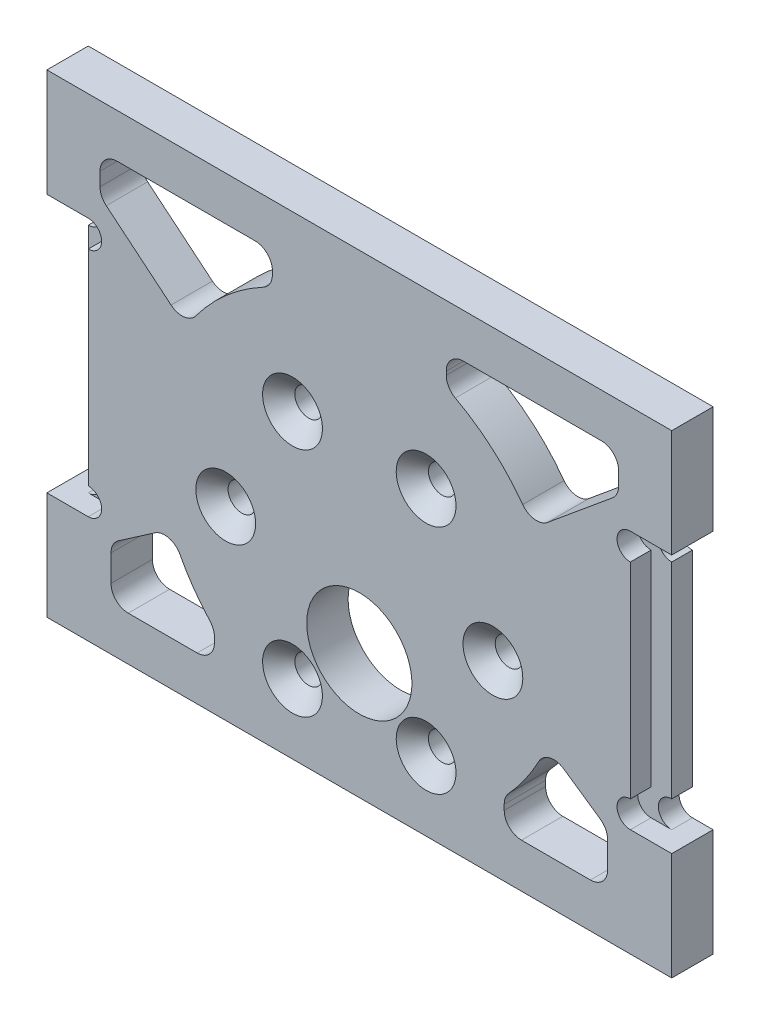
ISO-10303-21;
HEADER;
FILE_DESCRIPTION(('STEP AP214'),'2;1');
FILE_NAME('part.step','',(''),(''),'','','');
FILE_SCHEMA(('AUTOMOTIVE_DESIGN { 1 0 10303 214 1 1 1 1 }'));
ENDSEC;
DATA;
#1=APPLICATION_CONTEXT('core data for automotive mechanical design processes');
#2=APPLICATION_PROTOCOL_DEFINITION('international standard','automotive_design',2000,#1);
#3=PRODUCT_CONTEXT('',#1,'mechanical');
#4=PRODUCT('Part','Part','',(#3));
#5=PRODUCT_RELATED_PRODUCT_CATEGORY('part','',(#4));
#6=PRODUCT_DEFINITION_FORMATION('','',#4);
#7=PRODUCT_DEFINITION_CONTEXT('part definition',#1,'design');
#8=PRODUCT_DEFINITION('design','',#6,#7);
#9=PRODUCT_DEFINITION_SHAPE('','',#8);
#10=(LENGTH_UNIT() NAMED_UNIT(*) SI_UNIT(.MILLI.,.METRE.));
#11=(NAMED_UNIT(*) PLANE_ANGLE_UNIT() SI_UNIT($,.RADIAN.));
#12=(NAMED_UNIT(*) SI_UNIT($,.STERADIAN.) SOLID_ANGLE_UNIT());
#13=UNCERTAINTY_MEASURE_WITH_UNIT(LENGTH_MEASURE(1.E-05),#10,'distance_accuracy_value','');
#14=(GEOMETRIC_REPRESENTATION_CONTEXT(3) GLOBAL_UNCERTAINTY_ASSIGNED_CONTEXT((#13)) GLOBAL_UNIT_ASSIGNED_CONTEXT((#10,
#11,#12)) REPRESENTATION_CONTEXT('',''));
#15=CARTESIAN_POINT('',(0.,0.,0.));
#16=DIRECTION('',(0.,0.,1.));
#17=DIRECTION('',(1.,0.,0.));
#18=AXIS2_PLACEMENT_3D('',#15,#16,#17);
#19=CARTESIAN_POINT('',(-33.85,17.5,0.));
#20=DIRECTION('',(-1.,0.,0.));
#21=DIRECTION('',(0.,0.,1.));
#22=AXIS2_PLACEMENT_3D('',#19,#20,#21);
#23=PLANE('',#22);
#24=DIRECTION('',(0.,-1.,0.));
#25=VECTOR('',#24,1.);
#26=CARTESIAN_POINT('',(-33.85,17.5,0.));
#27=LINE('',#26,#25);
#28=CARTESIAN_POINT('',(-33.85,14.4,0.));
#29=VERTEX_POINT('',#28);
#30=CARTESIAN_POINT('',(-33.85,-9.4,0.));
#31=VERTEX_POINT('',#30);
#32=EDGE_CURVE('E10',#29,#31,#27,.T.);
#33=ORIENTED_EDGE('',*,*,#32,.T.);
#34=DIRECTION('',(0.,0.,1.));
#35=VECTOR('',#34,1.);
#36=CARTESIAN_POINT('',(-33.85,-9.4,0.));
#37=LINE('',#36,#35);
#38=CARTESIAN_POINT('',(-33.85,-9.4,2.4));
#39=VERTEX_POINT('',#38);
#40=EDGE_CURVE('E1044',#31,#39,#37,.T.);
#41=ORIENTED_EDGE('',*,*,#40,.T.);
#42=DIRECTION('',(0.,-1.,0.));
#43=VECTOR('',#42,1.);
#44=CARTESIAN_POINT('',(-33.85,17.5,2.4));
#45=LINE('',#44,#43);
#46=CARTESIAN_POINT('',(-33.85,14.4,2.4));
#47=VERTEX_POINT('',#46);
#48=EDGE_CURVE('E1009',#47,#39,#45,.T.);
#49=ORIENTED_EDGE('',*,*,#48,.F.);
#50=DIRECTION('',(0.,0.,1.));
#51=VECTOR('',#50,1.);
#52=CARTESIAN_POINT('',(-33.85,14.4,0.));
#53=LINE('',#52,#51);
#54=EDGE_CURVE('E770',#29,#47,#53,.T.);
#55=ORIENTED_EDGE('',*,*,#54,.F.);
#56=EDGE_LOOP('',(#33,#41,#49,#55));
#57=FACE_BOUND('',#56,.T.);
#58=ADVANCED_FACE('F16',(#57),#23,.T.);
#59=CARTESIAN_POINT('',(0.,0.,0.));
#60=DIRECTION('',(0.,0.,1.));
#61=DIRECTION('',(1.,0.,0.));
#62=AXIS2_PLACEMENT_3D('',#59,#60,#61);
#63=PLANE('',#62);
#64=CARTESIAN_POINT('',(0.,0.,0.));
#65=DIRECTION('',(0.,0.,1.));
#66=DIRECTION('',(1.,0.,0.));
#67=AXIS2_PLACEMENT_3D('',#64,#65,#66);
#68=CIRCLE('',#67,23.5269127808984);
#69=CARTESIAN_POINT('',(-20.8145238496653,-10.9668236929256,0.));
#70=VERTEX_POINT('',#69);
#71=CARTESIAN_POINT('',(-17.3385170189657,-15.9025611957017,0.));
#72=VERTEX_POINT('',#71);
#73=EDGE_CURVE('E638',#70,#72,#68,.T.);
#74=ORIENTED_EDGE('',*,*,#73,.F.);
#75=CARTESIAN_POINT('',(-22.5839463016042,-11.8991027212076,0.));
#76=DIRECTION('',(0.,0.,1.));
#77=DIRECTION('',(1.,0.,0.));
#78=AXIS2_PLACEMENT_3D('',#75,#76,#77);
#79=CIRCLE('',#78,2.);
#80=CARTESIAN_POINT('',(-23.7194122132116,-10.252677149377,0.));
#81=VERTEX_POINT('',#80);
#82=EDGE_CURVE('E630',#70,#81,#79,.T.);
#83=ORIENTED_EDGE('',*,*,#82,.T.);
#84=DIRECTION('',(0.823212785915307,0.567732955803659,0.));
#85=VECTOR('',#84,1.);
#86=CARTESIAN_POINT('',(-2.85351501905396,4.13759677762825,0.));
#87=LINE('',#86,#85);
#88=CARTESIAN_POINT('',(-27.947913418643,-13.1688848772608,0.));
#89=VERTEX_POINT('',#88);
#90=EDGE_CURVE('E612',#89,#81,#87,.T.);
#91=ORIENTED_EDGE('',*,*,#90,.F.);
#92=CARTESIAN_POINT('',(-26.8124475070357,-14.8153104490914,0.));
#93=DIRECTION('',(0.,0.,1.));
#94=DIRECTION('',(1.,0.,0.));
#95=AXIS2_PLACEMENT_3D('',#92,#93,#94);
#96=CIRCLE('',#95,2.);
#97=CARTESIAN_POINT('',(-28.8124475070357,-14.8153104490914,0.));
#98=VERTEX_POINT('',#97);
#99=EDGE_CURVE('E919',#89,#98,#96,.T.);
#100=ORIENTED_EDGE('',*,*,#99,.T.);
#101=DIRECTION('',(0.,1.,0.));
#102=VECTOR('',#101,1.);
#103=CARTESIAN_POINT('',(-28.8124475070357,0.,0.));
#104=LINE('',#103,#102);
#105=CARTESIAN_POINT('',(-28.8124475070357,-17.8706534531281,0.));
#106=VERTEX_POINT('',#105);
#107=EDGE_CURVE('E857',#106,#98,#104,.T.);
#108=ORIENTED_EDGE('',*,*,#107,.F.);
#109=CARTESIAN_POINT('',(-26.8124475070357,-17.8706534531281,0.));
#110=DIRECTION('',(0.,0.,1.));
#111=DIRECTION('',(1.,0.,0.));
#112=AXIS2_PLACEMENT_3D('',#109,#110,#111);
#113=CIRCLE('',#112,2.);
#114=CARTESIAN_POINT('',(-26.8124475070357,-19.8706534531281,0.));
#115=VERTEX_POINT('',#114);
#116=EDGE_CURVE('E789',#106,#115,#113,.T.);
#117=ORIENTED_EDGE('',*,*,#116,.T.);
#118=DIRECTION('',(-1.,0.,0.));
#119=VECTOR('',#118,1.);
#120=CARTESIAN_POINT('',(0.,-19.8706534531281,0.));
#121=LINE('',#120,#119);
#122=CARTESIAN_POINT('',(-18.8124475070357,-19.8706534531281,0.));
#123=VERTEX_POINT('',#122);
#124=EDGE_CURVE('E807',#123,#115,#121,.T.);
#125=ORIENTED_EDGE('',*,*,#124,.F.);
#126=CARTESIAN_POINT('',(-18.8124475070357,-17.8706534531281,0.));
#127=DIRECTION('',(0.,0.,1.));
#128=DIRECTION('',(1.,0.,0.));
#129=AXIS2_PLACEMENT_3D('',#126,#127,#128);
#130=CIRCLE('',#129,2.);
#131=CARTESIAN_POINT('',(-16.8124475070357,-17.8706534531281,0.));
#132=VERTEX_POINT('',#131);
#133=EDGE_CURVE('E739',#123,#132,#130,.T.);
#134=ORIENTED_EDGE('',*,*,#133,.T.);
#135=DIRECTION('',(0.,-1.,0.));
#136=VECTOR('',#135,1.);
#137=CARTESIAN_POINT('',(-16.8124475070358,0.,0.));
#138=LINE('',#137,#136);
#139=CARTESIAN_POINT('',(-16.8124475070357,-17.2544224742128,0.));
#140=VERTEX_POINT('',#139);
#141=EDGE_CURVE('E673',#140,#132,#138,.T.);
#142=ORIENTED_EDGE('',*,*,#141,.F.);
#143=CARTESIAN_POINT('',(-18.8124475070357,-17.2544224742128,0.));
#144=DIRECTION('',(0.,0.,1.));
#145=DIRECTION('',(1.,0.,0.));
#146=AXIS2_PLACEMENT_3D('',#143,#144,#145);
#147=CIRCLE('',#146,2.);
#148=EDGE_CURVE('E982',#140,#72,#147,.T.);
#149=ORIENTED_EDGE('',*,*,#148,.T.);
#150=EDGE_LOOP('',(#74,#83,#91,#100,#108,#117,#125,#134,#142,#149));
#151=FACE_BOUND('',#150,.T.);
#152=CARTESIAN_POINT('',(26.8124475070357,-14.8153104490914,0.));
#153=DIRECTION('',(0.,0.,1.));
#154=DIRECTION('',(1.,0.,0.));
#155=AXIS2_PLACEMENT_3D('',#152,#153,#154);
#156=CIRCLE('',#155,2.);
#157=CARTESIAN_POINT('',(28.8124475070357,-14.8153104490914,0.));
#158=VERTEX_POINT('',#157);
#159=CARTESIAN_POINT('',(27.947913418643,-13.1688848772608,0.));
#160=VERTEX_POINT('',#159);
#161=EDGE_CURVE('E656',#158,#160,#156,.T.);
#162=ORIENTED_EDGE('',*,*,#161,.T.);
#163=DIRECTION('',(-0.823212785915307,0.567732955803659,0.));
#164=VECTOR('',#163,1.);
#165=CARTESIAN_POINT('',(2.85351501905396,4.13759677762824,0.));
#166=LINE('',#165,#164);
#167=CARTESIAN_POINT('',(23.7194122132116,-10.252677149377,0.));
#168=VERTEX_POINT('',#167);
#169=EDGE_CURVE('E811',#160,#168,#166,.T.);
#170=ORIENTED_EDGE('',*,*,#169,.T.);
#171=CARTESIAN_POINT('',(22.5839463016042,-11.8991027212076,0.));
#172=DIRECTION('',(0.,0.,1.));
#173=DIRECTION('',(1.,0.,0.));
#174=AXIS2_PLACEMENT_3D('',#171,#172,#173);
#175=CIRCLE('',#174,2.);
#176=CARTESIAN_POINT('',(20.8145238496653,-10.9668236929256,0.));
#177=VERTEX_POINT('',#176);
#178=EDGE_CURVE('E812',#168,#177,#175,.T.);
#179=ORIENTED_EDGE('',*,*,#178,.T.);
#180=CARTESIAN_POINT('',(0.,0.,0.));
#181=DIRECTION('',(0.,0.,1.));
#182=DIRECTION('',(1.,0.,0.));
#183=AXIS2_PLACEMENT_3D('',#180,#181,#182);
#184=CIRCLE('',#183,23.5269127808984);
#185=CARTESIAN_POINT('',(17.3385170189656,-15.9025611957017,0.));
#186=VERTEX_POINT('',#185);
#187=EDGE_CURVE('E696',#186,#177,#184,.T.);
#188=ORIENTED_EDGE('',*,*,#187,.F.);
#189=CARTESIAN_POINT('',(18.8124475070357,-17.2544224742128,0.));
#190=DIRECTION('',(0.,0.,1.));
#191=DIRECTION('',(1.,0.,0.));
#192=AXIS2_PLACEMENT_3D('',#189,#190,#191);
#193=CIRCLE('',#192,2.);
#194=CARTESIAN_POINT('',(16.8124475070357,-17.2544224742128,0.));
#195=VERTEX_POINT('',#194);
#196=EDGE_CURVE('E1029',#186,#195,#193,.T.);
#197=ORIENTED_EDGE('',*,*,#196,.T.);
#198=DIRECTION('',(0.,-1.,0.));
#199=VECTOR('',#198,1.);
#200=CARTESIAN_POINT('',(16.8124475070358,0.,0.));
#201=LINE('',#200,#199);
#202=CARTESIAN_POINT('',(16.8124475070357,-17.8706534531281,0.));
#203=VERTEX_POINT('',#202);
#204=EDGE_CURVE('E745',#195,#203,#201,.T.);
#205=ORIENTED_EDGE('',*,*,#204,.T.);
#206=CARTESIAN_POINT('',(18.8124475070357,-17.8706534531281,0.));
#207=DIRECTION('',(0.,0.,1.));
#208=DIRECTION('',(1.,0.,0.));
#209=AXIS2_PLACEMENT_3D('',#206,#207,#208);
#210=CIRCLE('',#209,2.);
#211=CARTESIAN_POINT('',(18.8124475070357,-19.8706534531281,0.));
#212=VERTEX_POINT('',#211);
#213=EDGE_CURVE('E933',#203,#212,#210,.T.);
#214=ORIENTED_EDGE('',*,*,#213,.T.);
#215=DIRECTION('',(1.,0.,0.));
#216=VECTOR('',#215,1.);
#217=CARTESIAN_POINT('',(0.,-19.8706534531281,0.));
#218=LINE('',#217,#216);
#219=CARTESIAN_POINT('',(26.8124475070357,-19.8706534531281,0.));
#220=VERTEX_POINT('',#219);
#221=EDGE_CURVE('E938',#212,#220,#218,.T.);
#222=ORIENTED_EDGE('',*,*,#221,.T.);
#223=CARTESIAN_POINT('',(26.8124475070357,-17.8706534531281,0.));
#224=DIRECTION('',(0.,0.,1.));
#225=DIRECTION('',(1.,0.,0.));
#226=AXIS2_PLACEMENT_3D('',#223,#224,#225);
#227=CIRCLE('',#226,2.);
#228=CARTESIAN_POINT('',(28.8124475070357,-17.8706534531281,0.));
#229=VERTEX_POINT('',#228);
#230=EDGE_CURVE('E944',#220,#229,#227,.T.);
#231=ORIENTED_EDGE('',*,*,#230,.T.);
#232=DIRECTION('',(0.,1.,0.));
#233=VECTOR('',#232,1.);
#234=CARTESIAN_POINT('',(28.8124475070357,0.,0.));
#235=LINE('',#234,#233);
#236=EDGE_CURVE('E692',#229,#158,#235,.T.);
#237=ORIENTED_EDGE('',*,*,#236,.T.);
#238=EDGE_LOOP('',(#162,#170,#179,#188,#197,#205,#214,#222,#231,#237));
#239=FACE_BOUND('',#238,.T.);
#240=DIRECTION('',(-0.77039432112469,-0.637567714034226,0.));
#241=VECTOR('',#240,1.);
#242=CARTESIAN_POINT('',(2.21030345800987,-2.67078334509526,0.));
#243=LINE('',#242,#241);
#244=CARTESIAN_POINT('',(29.3619808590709,19.7995703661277,0.));
#245=VERTEX_POINT('',#244);
#246=CARTESIAN_POINT('',(21.8436005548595,13.5774625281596,0.));
#247=VERTEX_POINT('',#246);
#248=EDGE_CURVE('E763',#245,#247,#243,.T.);
#249=ORIENTED_EDGE('',*,*,#248,.F.);
#250=CARTESIAN_POINT('',(28.0868454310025,21.340359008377,0.));
#251=DIRECTION('',(0.,0.,1.));
#252=DIRECTION('',(1.,0.,0.));
#253=AXIS2_PLACEMENT_3D('',#250,#251,#252);
#254=CIRCLE('',#253,2.);
#255=CARTESIAN_POINT('',(30.0868454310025,21.340359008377,0.));
#256=VERTEX_POINT('',#255);
#257=EDGE_CURVE('E833',#245,#256,#254,.T.);
#258=ORIENTED_EDGE('',*,*,#257,.T.);
#259=DIRECTION('',(0.,-1.,0.));
#260=VECTOR('',#259,1.);
#261=CARTESIAN_POINT('',(30.0868454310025,0.,0.));
#262=LINE('',#261,#260);
#263=CARTESIAN_POINT('',(30.0868454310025,22.8994582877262,0.));
#264=VERTEX_POINT('',#263);
#265=EDGE_CURVE('E712',#264,#256,#262,.T.);
#266=ORIENTED_EDGE('',*,*,#265,.F.);
#267=CARTESIAN_POINT('',(28.0868454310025,22.8994582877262,0.));
#268=DIRECTION('',(0.,0.,1.));
#269=DIRECTION('',(1.,0.,0.));
#270=AXIS2_PLACEMENT_3D('',#267,#268,#269);
#271=CIRCLE('',#270,2.);
#272=CARTESIAN_POINT('',(28.0868454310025,24.8994582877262,0.));
#273=VERTEX_POINT('',#272);
#274=EDGE_CURVE('E1080',#264,#273,#271,.T.);
#275=ORIENTED_EDGE('',*,*,#274,.T.);
#276=DIRECTION('',(1.,0.,0.));
#277=VECTOR('',#276,1.);
#278=CARTESIAN_POINT('',(0.,24.8994582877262,0.));
#279=LINE('',#278,#277);
#280=CARTESIAN_POINT('',(12.0868454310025,24.8994582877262,0.));
#281=VERTEX_POINT('',#280);
#282=EDGE_CURVE('E1060',#281,#273,#279,.T.);
#283=ORIENTED_EDGE('',*,*,#282,.F.);
#284=CARTESIAN_POINT('',(12.0868454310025,22.8994582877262,0.));
#285=DIRECTION('',(0.,0.,1.));
#286=DIRECTION('',(1.,0.,0.));
#287=AXIS2_PLACEMENT_3D('',#284,#285,#286);
#288=CIRCLE('',#287,2.);
#289=CARTESIAN_POINT('',(10.0868454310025,22.8994582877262,0.));
#290=VERTEX_POINT('',#289);
#291=EDGE_CURVE('E730',#281,#290,#288,.T.);
#292=ORIENTED_EDGE('',*,*,#291,.T.);
#293=DIRECTION('',(0.,1.,0.));
#294=VECTOR('',#293,1.);
#295=CARTESIAN_POINT('',(10.0868454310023,0.,0.));
#296=LINE('',#295,#294);
#297=CARTESIAN_POINT('',(10.0868454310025,22.4840264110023,0.));
#298=VERTEX_POINT('',#297);
#299=EDGE_CURVE('E839',#298,#290,#296,.T.);
#300=ORIENTED_EDGE('',*,*,#299,.F.);
#301=CARTESIAN_POINT('',(12.0868454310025,22.4840264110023,0.));
#302=DIRECTION('',(0.,0.,1.));
#303=DIRECTION('',(1.,0.,0.));
#304=AXIS2_PLACEMENT_3D('',#301,#302,#303);
#305=CIRCLE('',#304,2.);
#306=CARTESIAN_POINT('',(11.1398570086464,20.7224325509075,0.));
#307=VERTEX_POINT('',#306);
#308=EDGE_CURVE('E784',#298,#307,#305,.T.);
#309=ORIENTED_EDGE('',*,*,#308,.T.);
#310=CARTESIAN_POINT('',(0.,0.,0.));
#311=DIRECTION('',(0.,0.,1.));
#312=DIRECTION('',(1.,0.,0.));
#313=AXIS2_PLACEMENT_3D('',#310,#311,#312);
#314=CIRCLE('',#313,23.5269127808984);
#315=CARTESIAN_POINT('',(18.9569529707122,13.9337561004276,0.));
#316=VERTEX_POINT('',#315);
#317=EDGE_CURVE('E967',#316,#307,#314,.T.);
#318=ORIENTED_EDGE('',*,*,#317,.F.);
#319=CARTESIAN_POINT('',(20.5684651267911,15.118251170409,0.));
#320=DIRECTION('',(0.,0.,1.));
#321=DIRECTION('',(1.,0.,0.));
#322=AXIS2_PLACEMENT_3D('',#319,#320,#321);
#323=CIRCLE('',#322,2.);
#324=EDGE_CURVE('E849',#316,#247,#323,.T.);
#325=ORIENTED_EDGE('',*,*,#324,.T.);
#326=EDGE_LOOP('',(#249,#258,#266,#275,#283,#292,#300,#309,#318,#325));
#327=FACE_BOUND('',#326,.T.);
#328=DIRECTION('',(0.77039432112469,-0.637567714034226,0.));
#329=VECTOR('',#328,1.);
#330=CARTESIAN_POINT('',(-2.21030345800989,-2.67078334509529,0.));
#331=LINE('',#330,#329);
#332=CARTESIAN_POINT('',(-29.3619808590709,19.7995703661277,0.));
#333=VERTEX_POINT('',#332);
#334=CARTESIAN_POINT('',(-21.8436005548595,13.5774625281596,0.));
#335=VERTEX_POINT('',#334);
#336=EDGE_CURVE('E1094',#333,#335,#331,.T.);
#337=ORIENTED_EDGE('',*,*,#336,.T.);
#338=CARTESIAN_POINT('',(-20.5684651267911,15.118251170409,0.));
#339=DIRECTION('',(0.,0.,1.));
#340=DIRECTION('',(1.,0.,0.));
#341=AXIS2_PLACEMENT_3D('',#338,#339,#340);
#342=CIRCLE('',#341,2.);
#343=CARTESIAN_POINT('',(-18.9569529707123,13.9337561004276,0.));
#344=VERTEX_POINT('',#343);
#345=EDGE_CURVE('E1017',#335,#344,#342,.T.);
#346=ORIENTED_EDGE('',*,*,#345,.T.);
#347=CARTESIAN_POINT('',(0.,0.,0.));
#348=DIRECTION('',(0.,0.,1.));
#349=DIRECTION('',(1.,0.,0.));
#350=AXIS2_PLACEMENT_3D('',#347,#348,#349);
#351=CIRCLE('',#350,23.5269127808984);
#352=CARTESIAN_POINT('',(-11.1398570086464,20.7224325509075,0.));
#353=VERTEX_POINT('',#352);
#354=EDGE_CURVE('E994',#353,#344,#351,.T.);
#355=ORIENTED_EDGE('',*,*,#354,.F.);
#356=CARTESIAN_POINT('',(-12.0868454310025,22.4840264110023,0.));
#357=DIRECTION('',(0.,0.,1.));
#358=DIRECTION('',(1.,0.,0.));
#359=AXIS2_PLACEMENT_3D('',#356,#357,#358);
#360=CIRCLE('',#359,2.);
#361=CARTESIAN_POINT('',(-10.0868454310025,22.4840264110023,0.));
#362=VERTEX_POINT('',#361);
#363=EDGE_CURVE('E672',#353,#362,#360,.T.);
#364=ORIENTED_EDGE('',*,*,#363,.T.);
#365=DIRECTION('',(0.,1.,0.));
#366=VECTOR('',#365,1.);
#367=CARTESIAN_POINT('',(-10.0868454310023,0.,0.));
#368=LINE('',#367,#366);
#369=CARTESIAN_POINT('',(-10.0868454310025,22.8994582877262,0.));
#370=VERTEX_POINT('',#369);
#371=EDGE_CURVE('E796',#362,#370,#368,.T.);
#372=ORIENTED_EDGE('',*,*,#371,.T.);
#373=CARTESIAN_POINT('',(-12.0868454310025,22.8994582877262,0.));
#374=DIRECTION('',(0.,0.,1.));
#375=DIRECTION('',(1.,0.,0.));
#376=AXIS2_PLACEMENT_3D('',#373,#374,#375);
#377=CIRCLE('',#376,2.);
#378=CARTESIAN_POINT('',(-12.0868454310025,24.8994582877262,0.));
#379=VERTEX_POINT('',#378);
#380=EDGE_CURVE('E1152',#370,#379,#377,.T.);
#381=ORIENTED_EDGE('',*,*,#380,.T.);
#382=DIRECTION('',(-1.,0.,0.));
#383=VECTOR('',#382,1.);
#384=CARTESIAN_POINT('',(0.,24.8994582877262,0.));
#385=LINE('',#384,#383);
#386=CARTESIAN_POINT('',(-28.0868454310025,24.8994582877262,0.));
#387=VERTEX_POINT('',#386);
#388=EDGE_CURVE('E728',#379,#387,#385,.T.);
#389=ORIENTED_EDGE('',*,*,#388,.T.);
#390=CARTESIAN_POINT('',(-28.0868454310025,22.8994582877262,0.));
#391=DIRECTION('',(0.,0.,1.));
#392=DIRECTION('',(1.,0.,0.));
#393=AXIS2_PLACEMENT_3D('',#390,#391,#392);
#394=CIRCLE('',#393,2.);
#395=CARTESIAN_POINT('',(-30.0868454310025,22.8994582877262,0.));
#396=VERTEX_POINT('',#395);
#397=EDGE_CURVE('E864',#387,#396,#394,.T.);
#398=ORIENTED_EDGE('',*,*,#397,.T.);
#399=DIRECTION('',(0.,-1.,0.));
#400=VECTOR('',#399,1.);
#401=CARTESIAN_POINT('',(-30.0868454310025,0.,0.));
#402=LINE('',#401,#400);
#403=CARTESIAN_POINT('',(-30.0868454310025,21.340359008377,0.));
#404=VERTEX_POINT('',#403);
#405=EDGE_CURVE('E754',#396,#404,#402,.T.);
#406=ORIENTED_EDGE('',*,*,#405,.T.);
#407=CARTESIAN_POINT('',(-28.0868454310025,21.340359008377,0.));
#408=DIRECTION('',(0.,0.,1.));
#409=DIRECTION('',(1.,0.,0.));
#410=AXIS2_PLACEMENT_3D('',#407,#408,#409);
#411=CIRCLE('',#410,2.);
#412=EDGE_CURVE('E687',#404,#333,#411,.T.);
#413=ORIENTED_EDGE('',*,*,#412,.T.);
#414=EDGE_LOOP('',(#337,#346,#355,#364,#372,#381,#389,#398,#406,#413));
#415=FACE_BOUND('',#414,.T.);
#416=DIRECTION('',(0.,1.,0.));
#417=VECTOR('',#416,1.);
#418=CARTESIAN_POINT('',(33.85,-12.5,0.));
#419=LINE('',#418,#417);
#420=CARTESIAN_POINT('',(33.85,-9.4,0.));
#421=VERTEX_POINT('',#420);
#422=CARTESIAN_POINT('',(33.85,14.4,0.));
#423=VERTEX_POINT('',#422);
#424=EDGE_CURVE('E774',#421,#423,#419,.T.);
#425=ORIENTED_EDGE('',*,*,#424,.F.);
#426=CARTESIAN_POINT('',(33.85,-10.95,0.));
#427=DIRECTION('',(0.,0.,1.));
#428=DIRECTION('',(0.,1.,0.));
#429=AXIS2_PLACEMENT_3D('',#426,#427,#428);
#430=CIRCLE('',#429,1.55);
#431=CARTESIAN_POINT('',(33.85,-12.5,0.));
#432=VERTEX_POINT('',#431);
#433=EDGE_CURVE('E718',#421,#432,#430,.T.);
#434=ORIENTED_EDGE('',*,*,#433,.T.);
#435=DIRECTION('',(-1.,0.,0.));
#436=VECTOR('',#435,1.);
#437=CARTESIAN_POINT('',(36.25,-12.5,0.));
#438=LINE('',#437,#436);
#439=CARTESIAN_POINT('',(36.25,-12.5,0.));
#440=VERTEX_POINT('',#439);
#441=EDGE_CURVE('E894',#440,#432,#438,.T.);
#442=ORIENTED_EDGE('',*,*,#441,.F.);
#443=DIRECTION('',(0.,1.,0.));
#444=VECTOR('',#443,1.);
#445=CARTESIAN_POINT('',(36.25,-25.,0.));
#446=LINE('',#445,#444);
#447=CARTESIAN_POINT('',(36.25,-25.,0.));
#448=VERTEX_POINT('',#447);
#449=EDGE_CURVE('E1050',#448,#440,#446,.T.);
#450=ORIENTED_EDGE('',*,*,#449,.F.);
#451=DIRECTION('',(1.,0.,0.));
#452=VECTOR('',#451,1.);
#453=CARTESIAN_POINT('',(-36.25,-25.,0.));
#454=LINE('',#453,#452);
#455=CARTESIAN_POINT('',(-36.25,-25.,0.));
#456=VERTEX_POINT('',#455);
#457=EDGE_CURVE('E698',#456,#448,#454,.T.);
#458=ORIENTED_EDGE('',*,*,#457,.F.);
#459=DIRECTION('',(0.,-1.,0.));
#460=VECTOR('',#459,1.);
#461=CARTESIAN_POINT('',(-36.25,-25.,0.));
#462=LINE('',#461,#460);
#463=CARTESIAN_POINT('',(-36.25,-12.5,0.));
#464=VERTEX_POINT('',#463);
#465=EDGE_CURVE('E1012',#464,#456,#462,.T.);
#466=ORIENTED_EDGE('',*,*,#465,.F.);
#467=DIRECTION('',(-1.,0.,0.));
#468=VECTOR('',#467,1.);
#469=CARTESIAN_POINT('',(-33.85,-12.5,0.));
#470=LINE('',#469,#468);
#471=CARTESIAN_POINT('',(-33.85,-12.5,0.));
#472=VERTEX_POINT('',#471);
#473=EDGE_CURVE('E802',#472,#464,#470,.T.);
#474=ORIENTED_EDGE('',*,*,#473,.F.);
#475=CARTESIAN_POINT('',(-33.85,-10.95,0.));
#476=DIRECTION('',(0.,0.,-1.));
#477=DIRECTION('',(0.,1.,0.));
#478=AXIS2_PLACEMENT_3D('',#475,#476,#477);
#479=CIRCLE('',#478,1.55);
#480=EDGE_CURVE('E1040',#31,#472,#479,.T.);
#481=ORIENTED_EDGE('',*,*,#480,.F.);
#482=ORIENTED_EDGE('',*,*,#32,.F.);
#483=CARTESIAN_POINT('',(-33.85,15.95,0.));
#484=DIRECTION('',(0.,0.,-1.));
#485=DIRECTION('',(0.,1.,0.));
#486=AXIS2_PLACEMENT_3D('',#483,#484,#485);
#487=CIRCLE('',#486,1.55);
#488=CARTESIAN_POINT('',(-33.85,17.5,0.));
#489=VERTEX_POINT('',#488);
#490=EDGE_CURVE('E775',#489,#29,#487,.T.);
#491=ORIENTED_EDGE('',*,*,#490,.F.);
#492=DIRECTION('',(1.,0.,0.));
#493=VECTOR('',#492,1.);
#494=CARTESIAN_POINT('',(-36.25,17.5,0.));
#495=LINE('',#494,#493);
#496=CARTESIAN_POINT('',(-36.25,17.5,0.));
#497=VERTEX_POINT('',#496);
#498=EDGE_CURVE('E1030',#497,#489,#495,.T.);
#499=ORIENTED_EDGE('',*,*,#498,.F.);
#500=DIRECTION('',(0.,-1.,0.));
#501=VECTOR('',#500,1.);
#502=CARTESIAN_POINT('',(-36.25,-25.,0.));
#503=LINE('',#502,#501);
#504=CARTESIAN_POINT('',(-36.25,30.,0.));
#505=VERTEX_POINT('',#504);
#506=EDGE_CURVE('E1047',#505,#497,#503,.T.);
#507=ORIENTED_EDGE('',*,*,#506,.F.);
#508=DIRECTION('',(-1.,0.,0.));
#509=VECTOR('',#508,1.);
#510=CARTESIAN_POINT('',(-36.25,30.,0.));
#511=LINE('',#510,#509);
#512=CARTESIAN_POINT('',(36.25,30.,0.));
#513=VERTEX_POINT('',#512);
#514=EDGE_CURVE('E948',#513,#505,#511,.T.);
#515=ORIENTED_EDGE('',*,*,#514,.F.);
#516=DIRECTION('',(0.,1.,0.));
#517=VECTOR('',#516,1.);
#518=CARTESIAN_POINT('',(36.25,-25.,0.));
#519=LINE('',#518,#517);
#520=CARTESIAN_POINT('',(36.25,17.5,0.));
#521=VERTEX_POINT('',#520);
#522=EDGE_CURVE('E27',#521,#513,#519,.T.);
#523=ORIENTED_EDGE('',*,*,#522,.F.);
#524=DIRECTION('',(1.,0.,0.));
#525=VECTOR('',#524,1.);
#526=CARTESIAN_POINT('',(33.85,17.5,0.));
#527=LINE('',#526,#525);
#528=CARTESIAN_POINT('',(33.85,17.5,0.));
#529=VERTEX_POINT('',#528);
#530=EDGE_CURVE('E950',#529,#521,#527,.T.);
#531=ORIENTED_EDGE('',*,*,#530,.F.);
#532=CARTESIAN_POINT('',(33.85,15.95,0.));
#533=DIRECTION('',(0.,0.,1.));
#534=DIRECTION('',(0.,1.,0.));
#535=AXIS2_PLACEMENT_3D('',#532,#533,#534);
#536=CIRCLE('',#535,1.55);
#537=EDGE_CURVE('E999',#529,#423,#536,.T.);
#538=ORIENTED_EDGE('',*,*,#537,.T.);
#539=EDGE_LOOP('',(#425,#434,#442,#450,#458,#466,#474,#481,#482,#491,#499,#507,#515,#523,#531,#538));
#540=FACE_BOUND('',#539,.T.);
#541=CARTESIAN_POINT('',(15.5,-3.5,0.));
#542=DIRECTION('',(0.,0.,1.));
#543=DIRECTION('',(-1.,0.,0.));
#544=AXIS2_PLACEMENT_3D('',#541,#542,#543);
#545=CIRCLE('',#544,1.6);
#546=CARTESIAN_POINT('',(13.9,-3.5,0.));
#547=VERTEX_POINT('',#546);
#548=EDGE_CURVE('E873',#547,#547,#545,.T.);
#549=ORIENTED_EDGE('',*,*,#548,.T.);
#550=EDGE_LOOP('',(#549));
#551=FACE_BOUND('',#550,.T.);
#552=CARTESIAN_POINT('',(7.75,-16.9233937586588,0.));
#553=DIRECTION('',(0.,0.,1.));
#554=DIRECTION('',(-1.,0.,0.));
#555=AXIS2_PLACEMENT_3D('',#552,#553,#554);
#556=CIRCLE('',#555,1.6);
#557=CARTESIAN_POINT('',(6.15,-16.9233937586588,0.));
#558=VERTEX_POINT('',#557);
#559=EDGE_CURVE('E869',#558,#558,#556,.T.);
#560=ORIENTED_EDGE('',*,*,#559,.T.);
#561=EDGE_LOOP('',(#560));
#562=FACE_BOUND('',#561,.T.);
#563=CARTESIAN_POINT('',(0.,-10.5,0.));
#564=DIRECTION('',(0.,0.,1.));
#565=DIRECTION('',(-1.,0.,0.));
#566=AXIS2_PLACEMENT_3D('',#563,#564,#565);
#567=CIRCLE('',#566,6.1);
#568=CARTESIAN_POINT('',(-6.1,-10.5,0.));
#569=VERTEX_POINT('',#568);
#570=EDGE_CURVE('E872',#569,#569,#567,.T.);
#571=ORIENTED_EDGE('',*,*,#570,.T.);
#572=EDGE_LOOP('',(#571));
#573=FACE_BOUND('',#572,.T.);
#574=CARTESIAN_POINT('',(-7.75,-16.9233937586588,0.));
#575=DIRECTION('',(0.,0.,1.));
#576=DIRECTION('',(-1.,0.,0.));
#577=AXIS2_PLACEMENT_3D('',#574,#575,#576);
#578=CIRCLE('',#577,1.6);
#579=CARTESIAN_POINT('',(-9.35,-16.9233937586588,0.));
#580=VERTEX_POINT('',#579);
#581=EDGE_CURVE('E724',#580,#580,#578,.T.);
#582=ORIENTED_EDGE('',*,*,#581,.T.);
#583=EDGE_LOOP('',(#582));
#584=FACE_BOUND('',#583,.T.);
#585=CARTESIAN_POINT('',(-15.5,-3.5,0.));
#586=DIRECTION('',(0.,0.,1.));
#587=DIRECTION('',(-1.,0.,0.));
#588=AXIS2_PLACEMENT_3D('',#585,#586,#587);
#589=CIRCLE('',#588,1.6);
#590=CARTESIAN_POINT('',(-17.1,-3.5,0.));
#591=VERTEX_POINT('',#590);
#592=EDGE_CURVE('E720',#591,#591,#589,.T.);
#593=ORIENTED_EDGE('',*,*,#592,.T.);
#594=EDGE_LOOP('',(#593));
#595=FACE_BOUND('',#594,.T.);
#596=CARTESIAN_POINT('',(-7.75,9.9233937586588,0.));
#597=DIRECTION('',(0.,0.,1.));
#598=DIRECTION('',(-1.,0.,0.));
#599=AXIS2_PLACEMENT_3D('',#596,#597,#598);
#600=CIRCLE('',#599,1.6);
#601=CARTESIAN_POINT('',(-9.35,9.9233937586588,0.));
#602=VERTEX_POINT('',#601);
#603=EDGE_CURVE('E723',#602,#602,#600,.T.);
#604=ORIENTED_EDGE('',*,*,#603,.T.);
#605=EDGE_LOOP('',(#604));
#606=FACE_BOUND('',#605,.T.);
#607=CARTESIAN_POINT('',(7.75,9.9233937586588,0.));
#608=DIRECTION('',(0.,0.,1.));
#609=DIRECTION('',(-1.,0.,0.));
#610=AXIS2_PLACEMENT_3D('',#607,#608,#609);
#611=CIRCLE('',#610,1.6);
#612=CARTESIAN_POINT('',(6.15,9.9233937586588,0.));
#613=VERTEX_POINT('',#612);
#614=EDGE_CURVE('E703',#613,#613,#611,.T.);
#615=ORIENTED_EDGE('',*,*,#614,.T.);
#616=EDGE_LOOP('',(#615));
#617=FACE_BOUND('',#616,.T.);
#618=ADVANCED_FACE('F635',(#151,#239,#327,#415,#540,#551,#562,#573,#584,#595,#606,#617),#63,.F.);
#619=CARTESIAN_POINT('',(36.25,-25.,4.8));
#620=DIRECTION('',(-1.,0.,0.));
#621=DIRECTION('',(0.,0.,1.));
#622=AXIS2_PLACEMENT_3D('',#619,#620,#621);
#623=PLANE('',#622);
#624=DIRECTION('',(0.,0.,1.));
#625=VECTOR('',#624,1.);
#626=CARTESIAN_POINT('',(36.25,17.5,2.4));
#627=LINE('',#626,#625);
#628=CARTESIAN_POINT('',(36.25,17.5,4.8));
#629=VERTEX_POINT('',#628);
#630=EDGE_CURVE('E954',#521,#629,#627,.T.);
#631=ORIENTED_EDGE('',*,*,#630,.F.);
#632=ORIENTED_EDGE('',*,*,#522,.T.);
#633=DIRECTION('',(0.,0.,-1.));
#634=VECTOR('',#633,1.);
#635=CARTESIAN_POINT('',(36.25,30.,4.8));
#636=LINE('',#635,#634);
#637=CARTESIAN_POINT('',(36.25,30.,4.8));
#638=VERTEX_POINT('',#637);
#639=EDGE_CURVE('E929',#638,#513,#636,.T.);
#640=ORIENTED_EDGE('',*,*,#639,.F.);
#641=DIRECTION('',(0.,1.,0.));
#642=VECTOR('',#641,1.);
#643=CARTESIAN_POINT('',(36.25,-25.,4.8));
#644=LINE('',#643,#642);
#645=EDGE_CURVE('E922',#629,#638,#644,.T.);
#646=ORIENTED_EDGE('',*,*,#645,.F.);
#647=EDGE_LOOP('',(#631,#632,#640,#646));
#648=FACE_BOUND('',#647,.T.);
#649=ADVANCED_FACE('F1431',(#648),#623,.F.);
#650=CARTESIAN_POINT('',(36.25,-25.,4.8));
#651=DIRECTION('',(-1.,0.,0.));
#652=DIRECTION('',(0.,0.,1.));
#653=AXIS2_PLACEMENT_3D('',#650,#651,#652);
#654=PLANE('',#653);
#655=ORIENTED_EDGE('',*,*,#449,.T.);
#656=DIRECTION('',(0.,0.,1.));
#657=VECTOR('',#656,1.);
#658=CARTESIAN_POINT('',(36.25,-12.5,2.4));
#659=LINE('',#658,#657);
#660=CARTESIAN_POINT('',(36.25,-12.5,4.8));
#661=VERTEX_POINT('',#660);
#662=EDGE_CURVE('E20',#440,#661,#659,.T.);
#663=ORIENTED_EDGE('',*,*,#662,.T.);
#664=DIRECTION('',(0.,1.,0.));
#665=VECTOR('',#664,1.);
#666=CARTESIAN_POINT('',(36.25,-25.,4.8));
#667=LINE('',#666,#665);
#668=CARTESIAN_POINT('',(36.25,-25.,4.8));
#669=VERTEX_POINT('',#668);
#670=EDGE_CURVE('E752',#669,#661,#667,.T.);
#671=ORIENTED_EDGE('',*,*,#670,.F.);
#672=DIRECTION('',(0.,0.,-1.));
#673=VECTOR('',#672,1.);
#674=CARTESIAN_POINT('',(36.25,-25.,4.8));
#675=LINE('',#674,#673);
#676=EDGE_CURVE('E702',#669,#448,#675,.T.);
#677=ORIENTED_EDGE('',*,*,#676,.T.);
#678=EDGE_LOOP('',(#655,#663,#671,#677));
#679=FACE_BOUND('',#678,.T.);
#680=ADVANCED_FACE('F1513',(#679),#654,.F.);
#681=CARTESIAN_POINT('',(31.45,15.95,2.4));
#682=DIRECTION('',(0.,0.,-1.));
#683=DIRECTION('',(0.,-1.,0.));
#684=AXIS2_PLACEMENT_3D('',#681,#682,#683);
#685=PLANE('',#684);
#686=DIRECTION('',(-1.,0.,0.));
#687=VECTOR('',#686,1.);
#688=CARTESIAN_POINT('',(36.25,-12.5,2.4));
#689=LINE('',#688,#687);
#690=CARTESIAN_POINT('',(33.85,-12.5,2.4));
#691=VERTEX_POINT('',#690);
#692=CARTESIAN_POINT('',(31.45,-12.5,2.4));
#693=VERTEX_POINT('',#692);
#694=EDGE_CURVE('E890',#691,#693,#689,.T.);
#695=ORIENTED_EDGE('',*,*,#694,.F.);
#696=CARTESIAN_POINT('',(33.85,-10.95,2.4));
#697=DIRECTION('',(0.,0.,1.));
#698=DIRECTION('',(0.,1.,0.));
#699=AXIS2_PLACEMENT_3D('',#696,#697,#698);
#700=CIRCLE('',#699,1.55);
#701=CARTESIAN_POINT('',(33.85,-9.4,2.4));
#702=VERTEX_POINT('',#701);
#703=EDGE_CURVE('E719',#702,#691,#700,.T.);
#704=ORIENTED_EDGE('',*,*,#703,.F.);
#705=DIRECTION('',(0.,1.,0.));
#706=VECTOR('',#705,1.);
#707=CARTESIAN_POINT('',(33.85,-12.5,2.4));
#708=LINE('',#707,#706);
#709=CARTESIAN_POINT('',(33.85,14.4,2.4));
#710=VERTEX_POINT('',#709);
#711=EDGE_CURVE('E937',#702,#710,#708,.T.);
#712=ORIENTED_EDGE('',*,*,#711,.T.);
#713=CARTESIAN_POINT('',(33.85,15.95,2.4));
#714=DIRECTION('',(0.,0.,1.));
#715=DIRECTION('',(0.,1.,0.));
#716=AXIS2_PLACEMENT_3D('',#713,#714,#715);
#717=CIRCLE('',#716,1.55);
#718=CARTESIAN_POINT('',(33.85,17.5,2.4));
#719=VERTEX_POINT('',#718);
#720=EDGE_CURVE('E1190',#719,#710,#717,.T.);
#721=ORIENTED_EDGE('',*,*,#720,.F.);
#722=DIRECTION('',(1.,0.,0.));
#723=VECTOR('',#722,1.);
#724=CARTESIAN_POINT('',(31.45,17.5,2.4));
#725=LINE('',#724,#723);
#726=CARTESIAN_POINT('',(31.45,17.5,2.4));
#727=VERTEX_POINT('',#726);
#728=EDGE_CURVE('E955',#727,#719,#725,.T.);
#729=ORIENTED_EDGE('',*,*,#728,.F.);
#730=CARTESIAN_POINT('',(31.45,15.95,2.4));
#731=DIRECTION('',(0.,0.,-1.));
#732=DIRECTION('',(1.,0.,0.));
#733=AXIS2_PLACEMENT_3D('',#730,#731,#732);
#734=CIRCLE('',#733,1.55);
#735=CARTESIAN_POINT('',(31.45,14.4,2.4));
#736=VERTEX_POINT('',#735);
#737=EDGE_CURVE('E945',#736,#727,#734,.T.);
#738=ORIENTED_EDGE('',*,*,#737,.F.);
#739=DIRECTION('',(0.,1.,0.));
#740=VECTOR('',#739,1.);
#741=CARTESIAN_POINT('',(31.45,-9.4,2.4));
#742=LINE('',#741,#740);
#743=CARTESIAN_POINT('',(31.45,-9.4,2.4));
#744=VERTEX_POINT('',#743);
#745=EDGE_CURVE('E678',#744,#736,#742,.T.);
#746=ORIENTED_EDGE('',*,*,#745,.F.);
#747=CARTESIAN_POINT('',(31.45,-10.95,2.4));
#748=DIRECTION('',(0.,0.,-1.));
#749=DIRECTION('',(1.,0.,0.));
#750=AXIS2_PLACEMENT_3D('',#747,#748,#749);
#751=CIRCLE('',#750,1.55);
#752=EDGE_CURVE('E898',#693,#744,#751,.T.);
#753=ORIENTED_EDGE('',*,*,#752,.F.);
#754=EDGE_LOOP('',(#695,#704,#712,#721,#729,#738,#746,#753));
#755=FACE_BOUND('',#754,.T.);
#756=ADVANCED_FACE('F1581',(#755),#685,.F.);
#757=CARTESIAN_POINT('',(-36.25,-25.,4.8));
#758=DIRECTION('',(1.,0.,0.));
#759=DIRECTION('',(0.,1.,0.));
#760=AXIS2_PLACEMENT_3D('',#757,#758,#759);
#761=PLANE('',#760);
#762=ORIENTED_EDGE('',*,*,#506,.T.);
#763=DIRECTION('',(0.,0.,1.));
#764=VECTOR('',#763,1.);
#765=CARTESIAN_POINT('',(-36.25,17.5,2.4));
#766=LINE('',#765,#764);
#767=CARTESIAN_POINT('',(-36.25,17.5,4.8));
#768=VERTEX_POINT('',#767);
#769=EDGE_CURVE('E1034',#497,#768,#766,.T.);
#770=ORIENTED_EDGE('',*,*,#769,.T.);
#771=DIRECTION('',(0.,-1.,0.));
#772=VECTOR('',#771,1.);
#773=CARTESIAN_POINT('',(-36.25,-25.,4.8));
#774=LINE('',#773,#772);
#775=CARTESIAN_POINT('',(-36.25,30.,4.8));
#776=VERTEX_POINT('',#775);
#777=EDGE_CURVE('E1013',#776,#768,#774,.T.);
#778=ORIENTED_EDGE('',*,*,#777,.F.);
#779=DIRECTION('',(0.,0.,-1.));
#780=VECTOR('',#779,1.);
#781=CARTESIAN_POINT('',(-36.25,30.,4.8));
#782=LINE('',#781,#780);
#783=EDGE_CURVE('E1138',#776,#505,#782,.T.);
#784=ORIENTED_EDGE('',*,*,#783,.T.);
#785=EDGE_LOOP('',(#762,#770,#778,#784));
#786=FACE_BOUND('',#785,.T.);
#787=ADVANCED_FACE('F1545',(#786),#761,.F.);
#788=CARTESIAN_POINT('',(-36.25,-25.,4.8));
#789=DIRECTION('',(1.,0.,0.));
#790=DIRECTION('',(0.,1.,0.));
#791=AXIS2_PLACEMENT_3D('',#788,#789,#790);
#792=PLANE('',#791);
#793=DIRECTION('',(0.,0.,1.));
#794=VECTOR('',#793,1.);
#795=CARTESIAN_POINT('',(-36.25,-12.5,2.4));
#796=LINE('',#795,#794);
#797=CARTESIAN_POINT('',(-36.25,-12.5,4.8));
#798=VERTEX_POINT('',#797);
#799=EDGE_CURVE('E797',#464,#798,#796,.T.);
#800=ORIENTED_EDGE('',*,*,#799,.F.);
#801=ORIENTED_EDGE('',*,*,#465,.T.);
#802=DIRECTION('',(0.,0.,-1.));
#803=VECTOR('',#802,1.);
#804=CARTESIAN_POINT('',(-36.25,-25.,4.8));
#805=LINE('',#804,#803);
#806=CARTESIAN_POINT('',(-36.25,-25.,4.8));
#807=VERTEX_POINT('',#806);
#808=EDGE_CURVE('E753',#807,#456,#805,.T.);
#809=ORIENTED_EDGE('',*,*,#808,.F.);
#810=DIRECTION('',(0.,-1.,0.));
#811=VECTOR('',#810,1.);
#812=CARTESIAN_POINT('',(-36.25,-25.,4.8));
#813=LINE('',#812,#811);
#814=EDGE_CURVE('E41',#798,#807,#813,.T.);
#815=ORIENTED_EDGE('',*,*,#814,.F.);
#816=EDGE_LOOP('',(#800,#801,#809,#815));
#817=FACE_BOUND('',#816,.T.);
#818=ADVANCED_FACE('F1573',(#817),#792,.F.);
#819=CARTESIAN_POINT('',(-31.45,-10.95,2.4));
#820=DIRECTION('',(0.,0.,1.));
#821=DIRECTION('',(1.,0.,0.));
#822=AXIS2_PLACEMENT_3D('',#819,#820,#821);
#823=PLANE('',#822);
#824=ORIENTED_EDGE('',*,*,#48,.T.);
#825=CARTESIAN_POINT('',(-33.85,-10.95,2.4));
#826=DIRECTION('',(0.,0.,-1.));
#827=DIRECTION('',(0.,1.,0.));
#828=AXIS2_PLACEMENT_3D('',#825,#826,#827);
#829=CIRCLE('',#828,1.55);
#830=CARTESIAN_POINT('',(-33.85,-12.5,2.4));
#831=VERTEX_POINT('',#830);
#832=EDGE_CURVE('E1128',#39,#831,#829,.T.);
#833=ORIENTED_EDGE('',*,*,#832,.T.);
#834=DIRECTION('',(1.,0.,0.));
#835=VECTOR('',#834,1.);
#836=CARTESIAN_POINT('',(-36.25,-12.5,2.4));
#837=LINE('',#836,#835);
#838=CARTESIAN_POINT('',(-31.45,-12.5,2.4));
#839=VERTEX_POINT('',#838);
#840=EDGE_CURVE('E1250',#831,#839,#837,.T.);
#841=ORIENTED_EDGE('',*,*,#840,.T.);
#842=CARTESIAN_POINT('',(-31.45,-10.95,2.4));
#843=DIRECTION('',(0.,0.,1.));
#844=DIRECTION('',(-1.,0.,0.));
#845=AXIS2_PLACEMENT_3D('',#842,#843,#844);
#846=CIRCLE('',#845,1.55);
#847=CARTESIAN_POINT('',(-31.45,-9.4,2.4));
#848=VERTEX_POINT('',#847);
#849=EDGE_CURVE('E1005',#839,#848,#846,.T.);
#850=ORIENTED_EDGE('',*,*,#849,.T.);
#851=DIRECTION('',(0.,1.,0.));
#852=VECTOR('',#851,1.);
#853=CARTESIAN_POINT('',(-31.45,-9.4,2.4));
#854=LINE('',#853,#852);
#855=CARTESIAN_POINT('',(-31.45,14.4,2.4));
#856=VERTEX_POINT('',#855);
#857=EDGE_CURVE('E816',#848,#856,#854,.T.);
#858=ORIENTED_EDGE('',*,*,#857,.T.);
#859=CARTESIAN_POINT('',(-31.45,15.95,2.4));
#860=DIRECTION('',(0.,0.,1.));
#861=DIRECTION('',(-1.,0.,0.));
#862=AXIS2_PLACEMENT_3D('',#859,#860,#861);
#863=CIRCLE('',#862,1.55);
#864=CARTESIAN_POINT('',(-31.45,17.5,2.4));
#865=VERTEX_POINT('',#864);
#866=EDGE_CURVE('E1095',#856,#865,#863,.T.);
#867=ORIENTED_EDGE('',*,*,#866,.T.);
#868=DIRECTION('',(-1.,0.,0.));
#869=VECTOR('',#868,1.);
#870=CARTESIAN_POINT('',(-31.45,17.5,2.4));
#871=LINE('',#870,#869);
#872=CARTESIAN_POINT('',(-33.85,17.5,2.4));
#873=VERTEX_POINT('',#872);
#874=EDGE_CURVE('E1033',#865,#873,#871,.T.);
#875=ORIENTED_EDGE('',*,*,#874,.T.);
#876=CARTESIAN_POINT('',(-33.85,15.95,2.4));
#877=DIRECTION('',(0.,0.,-1.));
#878=DIRECTION('',(0.,1.,0.));
#879=AXIS2_PLACEMENT_3D('',#876,#877,#878);
#880=CIRCLE('',#879,1.55);
#881=EDGE_CURVE('E764',#873,#47,#880,.T.);
#882=ORIENTED_EDGE('',*,*,#881,.T.);
#883=EDGE_LOOP('',(#824,#833,#841,#850,#858,#867,#875,#882));
#884=FACE_BOUND('',#883,.T.);
#885=ADVANCED_FACE('F1500',(#884),#823,.T.);
#886=CARTESIAN_POINT('',(0.,0.,4.8));
#887=DIRECTION('',(0.,0.,1.));
#888=DIRECTION('',(1.,0.,0.));
#889=AXIS2_PLACEMENT_3D('',#886,#887,#888);
#890=PLANE('',#889);
#891=CARTESIAN_POINT('',(7.75,-16.9233937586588,4.8));
#892=DIRECTION('',(0.,0.,-1.));
#893=DIRECTION('',(0.,1.,0.));
#894=AXIS2_PLACEMENT_3D('',#891,#892,#893);
#895=CIRCLE('',#894,3.47);
#896=CARTESIAN_POINT('',(7.75,-13.4533937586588,4.8));
#897=VERTEX_POINT('',#896);
#898=EDGE_CURVE('E1054',#897,#897,#895,.T.);
#899=ORIENTED_EDGE('',*,*,#898,.T.);
#900=EDGE_LOOP('',(#899));
#901=FACE_BOUND('',#900,.T.);
#902=CARTESIAN_POINT('',(15.5,-3.5,4.8));
#903=DIRECTION('',(0.,0.,-1.));
#904=DIRECTION('',(0.,1.,0.));
#905=AXIS2_PLACEMENT_3D('',#902,#903,#904);
#906=CIRCLE('',#905,3.47);
#907=CARTESIAN_POINT('',(15.5,-0.0299999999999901,4.8));
#908=VERTEX_POINT('',#907);
#909=EDGE_CURVE('E662',#908,#908,#906,.T.);
#910=ORIENTED_EDGE('',*,*,#909,.T.);
#911=EDGE_LOOP('',(#910));
#912=FACE_BOUND('',#911,.T.);
#913=CARTESIAN_POINT('',(7.75,9.9233937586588,4.8));
#914=DIRECTION('',(0.,0.,-1.));
#915=DIRECTION('',(0.,1.,0.));
#916=AXIS2_PLACEMENT_3D('',#913,#914,#915);
#917=CIRCLE('',#916,3.47);
#918=CARTESIAN_POINT('',(7.75,13.3933937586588,4.8));
#919=VERTEX_POINT('',#918);
#920=EDGE_CURVE('E1120',#919,#919,#917,.T.);
#921=ORIENTED_EDGE('',*,*,#920,.T.);
#922=EDGE_LOOP('',(#921));
#923=FACE_BOUND('',#922,.T.);
#924=CARTESIAN_POINT('',(-7.75,9.9233937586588,4.8));
#925=DIRECTION('',(0.,0.,-1.));
#926=DIRECTION('',(0.,1.,0.));
#927=AXIS2_PLACEMENT_3D('',#924,#925,#926);
#928=CIRCLE('',#927,3.47);
#929=CARTESIAN_POINT('',(-7.75,13.3933937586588,4.8));
#930=VERTEX_POINT('',#929);
#931=EDGE_CURVE('E1107',#930,#930,#928,.T.);
#932=ORIENTED_EDGE('',*,*,#931,.T.);
#933=EDGE_LOOP('',(#932));
#934=FACE_BOUND('',#933,.T.);
#935=CARTESIAN_POINT('',(-15.5,-3.5,4.8));
#936=DIRECTION('',(0.,0.,-1.));
#937=DIRECTION('',(0.,1.,0.));
#938=AXIS2_PLACEMENT_3D('',#935,#936,#937);
#939=CIRCLE('',#938,3.47);
#940=CARTESIAN_POINT('',(-15.5,-0.0300000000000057,4.8));
#941=VERTEX_POINT('',#940);
#942=EDGE_CURVE('E958',#941,#941,#939,.T.);
#943=ORIENTED_EDGE('',*,*,#942,.T.);
#944=EDGE_LOOP('',(#943));
#945=FACE_BOUND('',#944,.T.);
#946=CARTESIAN_POINT('',(-7.75,-16.9233937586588,4.8));
#947=DIRECTION('',(0.,0.,-1.));
#948=DIRECTION('',(0.,1.,0.));
#949=AXIS2_PLACEMENT_3D('',#946,#947,#948);
#950=CIRCLE('',#949,3.47);
#951=CARTESIAN_POINT('',(-7.75,-13.4533937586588,4.8));
#952=VERTEX_POINT('',#951);
#953=EDGE_CURVE('E642',#952,#952,#950,.T.);
#954=ORIENTED_EDGE('',*,*,#953,.T.);
#955=EDGE_LOOP('',(#954));
#956=FACE_BOUND('',#955,.T.);
#957=CARTESIAN_POINT('',(-22.5839463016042,-11.8991027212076,4.8));
#958=DIRECTION('',(0.,0.,-1.));
#959=DIRECTION('',(1.,0.,0.));
#960=AXIS2_PLACEMENT_3D('',#957,#958,#959);
#961=CIRCLE('',#960,2.);
#962=CARTESIAN_POINT('',(-23.7194122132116,-10.252677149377,4.8));
#963=VERTEX_POINT('',#962);
#964=CARTESIAN_POINT('',(-20.8145238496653,-10.9668236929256,4.8));
#965=VERTEX_POINT('',#964);
#966=EDGE_CURVE('E632',#963,#965,#961,.T.);
#967=ORIENTED_EDGE('',*,*,#966,.T.);
#968=CARTESIAN_POINT('',(0.,0.,4.8));
#969=DIRECTION('',(0.,0.,1.));
#970=DIRECTION('',(1.,0.,0.));
#971=AXIS2_PLACEMENT_3D('',#968,#969,#970);
#972=CIRCLE('',#971,23.5269127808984);
#973=CARTESIAN_POINT('',(-17.3385170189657,-15.9025611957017,4.8));
#974=VERTEX_POINT('',#973);
#975=EDGE_CURVE('E704',#965,#974,#972,.T.);
#976=ORIENTED_EDGE('',*,*,#975,.T.);
#977=CARTESIAN_POINT('',(-18.8124475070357,-17.2544224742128,4.8));
#978=DIRECTION('',(0.,0.,-1.));
#979=DIRECTION('',(-1.,0.,0.));
#980=AXIS2_PLACEMENT_3D('',#977,#978,#979);
#981=CIRCLE('',#980,2.);
#982=CARTESIAN_POINT('',(-16.8124475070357,-17.2544224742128,4.8));
#983=VERTEX_POINT('',#982);
#984=EDGE_CURVE('E889',#974,#983,#981,.T.);
#985=ORIENTED_EDGE('',*,*,#984,.T.);
#986=DIRECTION('',(0.,-1.,0.));
#987=VECTOR('',#986,1.);
#988=CARTESIAN_POINT('',(-16.8124475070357,-17.8706534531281,4.8));
#989=LINE('',#988,#987);
#990=CARTESIAN_POINT('',(-16.8124475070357,-17.8706534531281,4.8));
#991=VERTEX_POINT('',#990);
#992=EDGE_CURVE('E676',#983,#991,#989,.T.);
#993=ORIENTED_EDGE('',*,*,#992,.T.);
#994=CARTESIAN_POINT('',(-18.8124475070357,-17.8706534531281,4.8));
#995=DIRECTION('',(0.,0.,-1.));
#996=DIRECTION('',(1.,0.,0.));
#997=AXIS2_PLACEMENT_3D('',#994,#995,#996);
#998=CIRCLE('',#997,2.);
#999=CARTESIAN_POINT('',(-18.8124475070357,-19.8706534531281,4.8));
#1000=VERTEX_POINT('',#999);
#1001=EDGE_CURVE('E736',#991,#1000,#998,.T.);
#1002=ORIENTED_EDGE('',*,*,#1001,.T.);
#1003=DIRECTION('',(-1.,0.,0.));
#1004=VECTOR('',#1003,1.);
#1005=CARTESIAN_POINT('',(-26.8124475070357,-19.8706534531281,4.8));
#1006=LINE('',#1005,#1004);
#1007=CARTESIAN_POINT('',(-26.8124475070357,-19.8706534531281,4.8));
#1008=VERTEX_POINT('',#1007);
#1009=EDGE_CURVE('E803',#1000,#1008,#1006,.T.);
#1010=ORIENTED_EDGE('',*,*,#1009,.T.);
#1011=CARTESIAN_POINT('',(-26.8124475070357,-17.8706534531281,4.8));
#1012=DIRECTION('',(0.,0.,-1.));
#1013=DIRECTION('',(1.,0.,0.));
#1014=AXIS2_PLACEMENT_3D('',#1011,#1012,#1013);
#1015=CIRCLE('',#1014,2.);
#1016=CARTESIAN_POINT('',(-28.8124475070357,-17.8706534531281,4.8));
#1017=VERTEX_POINT('',#1016);
#1018=EDGE_CURVE('E1069',#1008,#1017,#1015,.T.);
#1019=ORIENTED_EDGE('',*,*,#1018,.T.);
#1020=DIRECTION('',(0.,1.,0.));
#1021=VECTOR('',#1020,1.);
#1022=CARTESIAN_POINT('',(-28.8124475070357,-17.8706534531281,4.8));
#1023=LINE('',#1022,#1021);
#1024=CARTESIAN_POINT('',(-28.8124475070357,-14.8153104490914,4.8));
#1025=VERTEX_POINT('',#1024);
#1026=EDGE_CURVE('E790',#1017,#1025,#1023,.T.);
#1027=ORIENTED_EDGE('',*,*,#1026,.T.);
#1028=CARTESIAN_POINT('',(-26.8124475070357,-14.8153104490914,4.8));
#1029=DIRECTION('',(0.,0.,-1.));
#1030=DIRECTION('',(1.,0.,0.));
#1031=AXIS2_PLACEMENT_3D('',#1028,#1029,#1030);
#1032=CIRCLE('',#1031,2.);
#1033=CARTESIAN_POINT('',(-27.947913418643,-13.1688848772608,4.8));
#1034=VERTEX_POINT('',#1033);
#1035=EDGE_CURVE('E915',#1025,#1034,#1032,.T.);
#1036=ORIENTED_EDGE('',*,*,#1035,.T.);
#1037=DIRECTION('',(0.823212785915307,0.567732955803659,0.));
#1038=VECTOR('',#1037,1.);
#1039=CARTESIAN_POINT('',(-27.947913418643,-13.1688848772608,4.8));
#1040=LINE('',#1039,#1038);
#1041=EDGE_CURVE('E624',#1034,#963,#1040,.T.);
#1042=ORIENTED_EDGE('',*,*,#1041,.T.);
#1043=EDGE_LOOP('',(#967,#976,#985,#993,#1002,#1010,#1019,#1027,#1036,#1042));
#1044=FACE_BOUND('',#1043,.T.);
#1045=DIRECTION('',(-0.823212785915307,0.567732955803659,0.));
#1046=VECTOR('',#1045,1.);
#1047=CARTESIAN_POINT('',(27.947913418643,-13.1688848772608,4.8));
#1048=LINE('',#1047,#1046);
#1049=CARTESIAN_POINT('',(27.947913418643,-13.1688848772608,4.8));
#1050=VERTEX_POINT('',#1049);
#1051=CARTESIAN_POINT('',(23.7194122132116,-10.252677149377,4.8));
#1052=VERTEX_POINT('',#1051);
#1053=EDGE_CURVE('E808',#1050,#1052,#1048,.T.);
#1054=ORIENTED_EDGE('',*,*,#1053,.F.);
#1055=CARTESIAN_POINT('',(26.8124475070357,-14.8153104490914,4.8));
#1056=DIRECTION('',(0.,0.,1.));
#1057=DIRECTION('',(-1.,0.,0.));
#1058=AXIS2_PLACEMENT_3D('',#1055,#1056,#1057);
#1059=CIRCLE('',#1058,2.);
#1060=CARTESIAN_POINT('',(28.8124475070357,-14.8153104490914,4.8));
#1061=VERTEX_POINT('',#1060);
#1062=EDGE_CURVE('E828',#1061,#1050,#1059,.T.);
#1063=ORIENTED_EDGE('',*,*,#1062,.F.);
#1064=DIRECTION('',(0.,1.,0.));
#1065=VECTOR('',#1064,1.);
#1066=CARTESIAN_POINT('',(28.8124475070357,-17.8706534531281,4.8));
#1067=LINE('',#1066,#1065);
#1068=CARTESIAN_POINT('',(28.8124475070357,-17.8706534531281,4.8));
#1069=VERTEX_POINT('',#1068);
#1070=EDGE_CURVE('E689',#1069,#1061,#1067,.T.);
#1071=ORIENTED_EDGE('',*,*,#1070,.F.);
#1072=CARTESIAN_POINT('',(26.8124475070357,-17.8706534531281,4.8));
#1073=DIRECTION('',(0.,0.,1.));
#1074=DIRECTION('',(-1.,0.,0.));
#1075=AXIS2_PLACEMENT_3D('',#1072,#1073,#1074);
#1076=CIRCLE('',#1075,2.);
#1077=CARTESIAN_POINT('',(26.8124475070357,-19.8706534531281,4.8));
#1078=VERTEX_POINT('',#1077);
#1079=EDGE_CURVE('E838',#1078,#1069,#1076,.T.);
#1080=ORIENTED_EDGE('',*,*,#1079,.F.);
#1081=DIRECTION('',(1.,0.,0.));
#1082=VECTOR('',#1081,1.);
#1083=CARTESIAN_POINT('',(26.8124475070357,-19.8706534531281,4.8));
#1084=LINE('',#1083,#1082);
#1085=CARTESIAN_POINT('',(18.8124475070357,-19.8706534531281,4.8));
#1086=VERTEX_POINT('',#1085);
#1087=EDGE_CURVE('E941',#1086,#1078,#1084,.T.);
#1088=ORIENTED_EDGE('',*,*,#1087,.F.);
#1089=CARTESIAN_POINT('',(18.8124475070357,-17.8706534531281,4.8));
#1090=DIRECTION('',(0.,0.,1.));
#1091=DIRECTION('',(1.,0.,0.));
#1092=AXIS2_PLACEMENT_3D('',#1089,#1090,#1091);
#1093=CIRCLE('',#1092,2.);
#1094=CARTESIAN_POINT('',(16.8124475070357,-17.8706534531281,4.8));
#1095=VERTEX_POINT('',#1094);
#1096=EDGE_CURVE('E930',#1095,#1086,#1093,.T.);
#1097=ORIENTED_EDGE('',*,*,#1096,.F.);
#1098=DIRECTION('',(0.,-1.,0.));
#1099=VECTOR('',#1098,1.);
#1100=CARTESIAN_POINT('',(16.8124475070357,-17.8706534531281,4.8));
#1101=LINE('',#1100,#1099);
#1102=CARTESIAN_POINT('',(16.8124475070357,-17.2544224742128,4.8));
#1103=VERTEX_POINT('',#1102);
#1104=EDGE_CURVE('E776',#1103,#1095,#1101,.T.);
#1105=ORIENTED_EDGE('',*,*,#1104,.F.);
#1106=CARTESIAN_POINT('',(18.8124475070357,-17.2544224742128,4.8));
#1107=DIRECTION('',(0.,0.,1.));
#1108=DIRECTION('',(1.,0.,0.));
#1109=AXIS2_PLACEMENT_3D('',#1106,#1107,#1108);
#1110=CIRCLE('',#1109,2.);
#1111=CARTESIAN_POINT('',(17.3385170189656,-15.9025611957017,4.8));
#1112=VERTEX_POINT('',#1111);
#1113=EDGE_CURVE('E744',#1112,#1103,#1110,.T.);
#1114=ORIENTED_EDGE('',*,*,#1113,.F.);
#1115=CARTESIAN_POINT('',(0.,0.,4.8));
#1116=DIRECTION('',(0.,0.,-1.));
#1117=DIRECTION('',(1.,0.,0.));
#1118=AXIS2_PLACEMENT_3D('',#1115,#1116,#1117);
#1119=CIRCLE('',#1118,23.5269127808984);
#1120=CARTESIAN_POINT('',(20.8145238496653,-10.9668236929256,4.8));
#1121=VERTEX_POINT('',#1120);
#1122=EDGE_CURVE('E693',#1121,#1112,#1119,.T.);
#1123=ORIENTED_EDGE('',*,*,#1122,.F.);
#1124=CARTESIAN_POINT('',(22.5839463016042,-11.8991027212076,4.8));
#1125=DIRECTION('',(0.,0.,1.));
#1126=DIRECTION('',(1.,0.,0.));
#1127=AXIS2_PLACEMENT_3D('',#1124,#1125,#1126);
#1128=CIRCLE('',#1127,2.);
#1129=EDGE_CURVE('E818',#1052,#1121,#1128,.T.);
#1130=ORIENTED_EDGE('',*,*,#1129,.F.);
#1131=EDGE_LOOP('',(#1054,#1063,#1071,#1080,#1088,#1097,#1105,#1114,#1123,#1130));
#1132=FACE_BOUND('',#1131,.T.);
#1133=CARTESIAN_POINT('',(28.0868454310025,21.340359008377,4.8));
#1134=DIRECTION('',(0.,0.,-1.));
#1135=DIRECTION('',(-1.,0.,0.));
#1136=AXIS2_PLACEMENT_3D('',#1133,#1134,#1135);
#1137=CIRCLE('',#1136,2.);
#1138=CARTESIAN_POINT('',(30.0868454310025,21.340359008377,4.8));
#1139=VERTEX_POINT('',#1138);
#1140=CARTESIAN_POINT('',(29.3619808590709,19.7995703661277,4.8));
#1141=VERTEX_POINT('',#1140);
#1142=EDGE_CURVE('E713',#1139,#1141,#1137,.T.);
#1143=ORIENTED_EDGE('',*,*,#1142,.T.);
#1144=DIRECTION('',(-0.77039432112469,-0.637567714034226,0.));
#1145=VECTOR('',#1144,1.);
#1146=CARTESIAN_POINT('',(29.3619808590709,19.7995703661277,4.8));
#1147=LINE('',#1146,#1145);
#1148=CARTESIAN_POINT('',(21.8436005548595,13.5774625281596,4.8));
#1149=VERTEX_POINT('',#1148);
#1150=EDGE_CURVE('E759',#1141,#1149,#1147,.T.);
#1151=ORIENTED_EDGE('',*,*,#1150,.T.);
#1152=CARTESIAN_POINT('',(20.5684651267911,15.118251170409,4.8));
#1153=DIRECTION('',(0.,0.,-1.));
#1154=DIRECTION('',(1.,0.,0.));
#1155=AXIS2_PLACEMENT_3D('',#1152,#1153,#1154);
#1156=CIRCLE('',#1155,2.);
#1157=CARTESIAN_POINT('',(18.9569529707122,13.9337561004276,4.8));
#1158=VERTEX_POINT('',#1157);
#1159=EDGE_CURVE('E852',#1149,#1158,#1156,.T.);
#1160=ORIENTED_EDGE('',*,*,#1159,.T.);
#1161=CARTESIAN_POINT('',(0.,0.,4.8));
#1162=DIRECTION('',(0.,0.,1.));
#1163=DIRECTION('',(1.,0.,0.));
#1164=AXIS2_PLACEMENT_3D('',#1161,#1162,#1163);
#1165=CIRCLE('',#1164,23.5269127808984);
#1166=CARTESIAN_POINT('',(11.1398570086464,20.7224325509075,4.8));
#1167=VERTEX_POINT('',#1166);
#1168=EDGE_CURVE('E926',#1158,#1167,#1165,.T.);
#1169=ORIENTED_EDGE('',*,*,#1168,.T.);
#1170=CARTESIAN_POINT('',(12.0868454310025,22.4840264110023,4.8));
#1171=DIRECTION('',(0.,0.,-1.));
#1172=DIRECTION('',(1.,0.,0.));
#1173=AXIS2_PLACEMENT_3D('',#1170,#1171,#1172);
#1174=CIRCLE('',#1173,2.);
#1175=CARTESIAN_POINT('',(10.0868454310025,22.4840264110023,4.8));
#1176=VERTEX_POINT('',#1175);
#1177=EDGE_CURVE('E780',#1167,#1176,#1174,.T.);
#1178=ORIENTED_EDGE('',*,*,#1177,.T.);
#1179=DIRECTION('',(0.,1.,0.));
#1180=VECTOR('',#1179,1.);
#1181=CARTESIAN_POINT('',(10.0868454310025,22.8994582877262,4.8));
#1182=LINE('',#1181,#1180);
#1183=CARTESIAN_POINT('',(10.0868454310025,22.8994582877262,4.8));
#1184=VERTEX_POINT('',#1183);
#1185=EDGE_CURVE('E842',#1176,#1184,#1182,.T.);
#1186=ORIENTED_EDGE('',*,*,#1185,.T.);
#1187=CARTESIAN_POINT('',(12.0868454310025,22.8994582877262,4.8));
#1188=DIRECTION('',(0.,0.,-1.));
#1189=DIRECTION('',(1.,0.,0.));
#1190=AXIS2_PLACEMENT_3D('',#1187,#1188,#1189);
#1191=CIRCLE('',#1190,2.);
#1192=CARTESIAN_POINT('',(12.0868454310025,24.8994582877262,4.8));
#1193=VERTEX_POINT('',#1192);
#1194=EDGE_CURVE('E734',#1184,#1193,#1191,.T.);
#1195=ORIENTED_EDGE('',*,*,#1194,.T.);
#1196=DIRECTION('',(1.,0.,0.));
#1197=VECTOR('',#1196,1.);
#1198=CARTESIAN_POINT('',(28.0868454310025,24.8994582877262,4.8));
#1199=LINE('',#1198,#1197);
#1200=CARTESIAN_POINT('',(28.0868454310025,24.8994582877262,4.8));
#1201=VERTEX_POINT('',#1200);
#1202=EDGE_CURVE('E1064',#1193,#1201,#1199,.T.);
#1203=ORIENTED_EDGE('',*,*,#1202,.T.);
#1204=CARTESIAN_POINT('',(28.0868454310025,22.8994582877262,4.8));
#1205=DIRECTION('',(0.,0.,-1.));
#1206=DIRECTION('',(-1.,0.,0.));
#1207=AXIS2_PLACEMENT_3D('',#1204,#1205,#1206);
#1208=CIRCLE('',#1207,2.);
#1209=CARTESIAN_POINT('',(30.0868454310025,22.8994582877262,4.8));
#1210=VERTEX_POINT('',#1209);
#1211=EDGE_CURVE('E1088',#1201,#1210,#1208,.T.);
#1212=ORIENTED_EDGE('',*,*,#1211,.T.);
#1213=DIRECTION('',(0.,-1.,0.));
#1214=VECTOR('',#1213,1.);
#1215=CARTESIAN_POINT('',(30.0868454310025,22.8994582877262,4.8));
#1216=LINE('',#1215,#1214);
#1217=EDGE_CURVE('E860',#1210,#1139,#1216,.T.);
#1218=ORIENTED_EDGE('',*,*,#1217,.T.);
#1219=EDGE_LOOP('',(#1143,#1151,#1160,#1169,#1178,#1186,#1195,#1203,#1212,#1218));
#1220=FACE_BOUND('',#1219,.T.);
#1221=CARTESIAN_POINT('',(-20.5684651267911,15.118251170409,4.8));
#1222=DIRECTION('',(0.,0.,1.));
#1223=DIRECTION('',(1.,0.,0.));
#1224=AXIS2_PLACEMENT_3D('',#1221,#1222,#1223);
#1225=CIRCLE('',#1224,2.);
#1226=CARTESIAN_POINT('',(-21.8436005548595,13.5774625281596,4.8));
#1227=VERTEX_POINT('',#1226);
#1228=CARTESIAN_POINT('',(-18.9569529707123,13.9337561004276,4.8));
#1229=VERTEX_POINT('',#1228);
#1230=EDGE_CURVE('E1014',#1227,#1229,#1225,.T.);
#1231=ORIENTED_EDGE('',*,*,#1230,.F.);
#1232=DIRECTION('',(0.77039432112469,-0.637567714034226,0.));
#1233=VECTOR('',#1232,1.);
#1234=CARTESIAN_POINT('',(-29.3619808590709,19.7995703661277,4.8));
#1235=LINE('',#1234,#1233);
#1236=CARTESIAN_POINT('',(-29.3619808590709,19.7995703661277,4.8));
#1237=VERTEX_POINT('',#1236);
#1238=EDGE_CURVE('E902',#1237,#1227,#1235,.T.);
#1239=ORIENTED_EDGE('',*,*,#1238,.F.);
#1240=CARTESIAN_POINT('',(-28.0868454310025,21.340359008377,4.8));
#1241=DIRECTION('',(0.,0.,1.));
#1242=DIRECTION('',(1.,0.,0.));
#1243=AXIS2_PLACEMENT_3D('',#1240,#1241,#1242);
#1244=CIRCLE('',#1243,2.);
#1245=CARTESIAN_POINT('',(-30.0868454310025,21.340359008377,4.8));
#1246=VERTEX_POINT('',#1245);
#1247=EDGE_CURVE('E684',#1246,#1237,#1244,.T.);
#1248=ORIENTED_EDGE('',*,*,#1247,.F.);
#1249=DIRECTION('',(0.,-1.,0.));
#1250=VECTOR('',#1249,1.);
#1251=CARTESIAN_POINT('',(-30.0868454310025,22.8994582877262,4.8));
#1252=LINE('',#1251,#1250);
#1253=CARTESIAN_POINT('',(-30.0868454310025,22.8994582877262,4.8));
#1254=VERTEX_POINT('',#1253);
#1255=EDGE_CURVE('E758',#1254,#1246,#1252,.T.);
#1256=ORIENTED_EDGE('',*,*,#1255,.F.);
#1257=CARTESIAN_POINT('',(-28.0868454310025,22.8994582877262,4.8));
#1258=DIRECTION('',(0.,0.,1.));
#1259=DIRECTION('',(1.,0.,0.));
#1260=AXIS2_PLACEMENT_3D('',#1257,#1258,#1259);
#1261=CIRCLE('',#1260,2.);
#1262=CARTESIAN_POINT('',(-28.0868454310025,24.8994582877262,4.8));
#1263=VERTEX_POINT('',#1262);
#1264=EDGE_CURVE('E861',#1263,#1254,#1261,.T.);
#1265=ORIENTED_EDGE('',*,*,#1264,.F.);
#1266=DIRECTION('',(-1.,0.,0.));
#1267=VECTOR('',#1266,1.);
#1268=CARTESIAN_POINT('',(-28.0868454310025,24.8994582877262,4.8));
#1269=LINE('',#1268,#1267);
#1270=CARTESIAN_POINT('',(-12.0868454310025,24.8994582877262,4.8));
#1271=VERTEX_POINT('',#1270);
#1272=EDGE_CURVE('E725',#1271,#1263,#1269,.T.);
#1273=ORIENTED_EDGE('',*,*,#1272,.F.);
#1274=CARTESIAN_POINT('',(-12.0868454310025,22.8994582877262,4.8));
#1275=DIRECTION('',(0.,0.,1.));
#1276=DIRECTION('',(-1.,0.,0.));
#1277=AXIS2_PLACEMENT_3D('',#1274,#1275,#1276);
#1278=CIRCLE('',#1277,2.);
#1279=CARTESIAN_POINT('',(-10.0868454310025,22.8994582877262,4.8));
#1280=VERTEX_POINT('',#1279);
#1281=EDGE_CURVE('E1173',#1280,#1271,#1278,.T.);
#1282=ORIENTED_EDGE('',*,*,#1281,.F.);
#1283=DIRECTION('',(0.,1.,0.));
#1284=VECTOR('',#1283,1.);
#1285=CARTESIAN_POINT('',(-10.0868454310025,22.8994582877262,4.8));
#1286=LINE('',#1285,#1284);
#1287=CARTESIAN_POINT('',(-10.0868454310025,22.4840264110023,4.8));
#1288=VERTEX_POINT('',#1287);
#1289=EDGE_CURVE('E964',#1288,#1280,#1286,.T.);
#1290=ORIENTED_EDGE('',*,*,#1289,.F.);
#1291=CARTESIAN_POINT('',(-12.0868454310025,22.4840264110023,4.8));
#1292=DIRECTION('',(0.,0.,1.));
#1293=DIRECTION('',(-1.,0.,0.));
#1294=AXIS2_PLACEMENT_3D('',#1291,#1292,#1293);
#1295=CIRCLE('',#1294,2.);
#1296=CARTESIAN_POINT('',(-11.1398570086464,20.7224325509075,4.8));
#1297=VERTEX_POINT('',#1296);
#1298=EDGE_CURVE('E795',#1297,#1288,#1295,.T.);
#1299=ORIENTED_EDGE('',*,*,#1298,.F.);
#1300=CARTESIAN_POINT('',(0.,0.,4.8));
#1301=DIRECTION('',(0.,0.,-1.));
#1302=DIRECTION('',(1.,0.,0.));
#1303=AXIS2_PLACEMENT_3D('',#1300,#1301,#1302);
#1304=CIRCLE('',#1303,23.5269127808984);
#1305=EDGE_CURVE('E671',#1229,#1297,#1304,.T.);
#1306=ORIENTED_EDGE('',*,*,#1305,.F.);
#1307=EDGE_LOOP('',(#1231,#1239,#1248,#1256,#1265,#1273,#1282,#1290,#1299,#1306));
#1308=FACE_BOUND('',#1307,.T.);
#1309=DIRECTION('',(-1.,0.,0.));
#1310=VECTOR('',#1309,1.);
#1311=CARTESIAN_POINT('',(-31.45,17.5,4.8));
#1312=LINE('',#1311,#1310);
#1313=CARTESIAN_POINT('',(-31.45,17.5,4.8));
#1314=VERTEX_POINT('',#1313);
#1315=EDGE_CURVE('E801',#1314,#768,#1312,.T.);
#1316=ORIENTED_EDGE('',*,*,#1315,.F.);
#1317=CARTESIAN_POINT('',(-31.45,15.95,4.8));
#1318=DIRECTION('',(0.,0.,1.));
#1319=DIRECTION('',(-1.,0.,0.));
#1320=AXIS2_PLACEMENT_3D('',#1317,#1318,#1319);
#1321=CIRCLE('',#1320,1.55);
#1322=CARTESIAN_POINT('',(-31.45,14.4,4.8));
#1323=VERTEX_POINT('',#1322);
#1324=EDGE_CURVE('E654',#1323,#1314,#1321,.T.);
#1325=ORIENTED_EDGE('',*,*,#1324,.F.);
#1326=DIRECTION('',(0.,1.,0.));
#1327=VECTOR('',#1326,1.);
#1328=CARTESIAN_POINT('',(-31.45,-9.4,4.8));
#1329=LINE('',#1328,#1327);
#1330=CARTESIAN_POINT('',(-31.45,-9.4,4.8));
#1331=VERTEX_POINT('',#1330);
#1332=EDGE_CURVE('E813',#1331,#1323,#1329,.T.);
#1333=ORIENTED_EDGE('',*,*,#1332,.F.);
#1334=CARTESIAN_POINT('',(-31.45,-10.95,4.8));
#1335=DIRECTION('',(0.,0.,1.));
#1336=DIRECTION('',(-1.,0.,0.));
#1337=AXIS2_PLACEMENT_3D('',#1334,#1335,#1336);
#1338=CIRCLE('',#1337,1.55);
#1339=CARTESIAN_POINT('',(-31.45,-12.5,4.8));
#1340=VERTEX_POINT('',#1339);
#1341=EDGE_CURVE('E911',#1340,#1331,#1338,.T.);
#1342=ORIENTED_EDGE('',*,*,#1341,.F.);
#1343=DIRECTION('',(1.,0.,0.));
#1344=VECTOR('',#1343,1.);
#1345=CARTESIAN_POINT('',(-36.25,-12.5,4.8));
#1346=LINE('',#1345,#1344);
#1347=EDGE_CURVE('E1154',#798,#1340,#1346,.T.);
#1348=ORIENTED_EDGE('',*,*,#1347,.F.);
#1349=ORIENTED_EDGE('',*,*,#814,.T.);
#1350=DIRECTION('',(1.,0.,0.));
#1351=VECTOR('',#1350,1.);
#1352=CARTESIAN_POINT('',(-36.25,-25.,4.8));
#1353=LINE('',#1352,#1351);
#1354=EDGE_CURVE('E882',#807,#669,#1353,.T.);
#1355=ORIENTED_EDGE('',*,*,#1354,.T.);
#1356=ORIENTED_EDGE('',*,*,#670,.T.);
#1357=DIRECTION('',(-1.,0.,0.));
#1358=VECTOR('',#1357,1.);
#1359=CARTESIAN_POINT('',(36.25,-12.5,4.8));
#1360=LINE('',#1359,#1358);
#1361=CARTESIAN_POINT('',(31.45,-12.5,4.8));
#1362=VERTEX_POINT('',#1361);
#1363=EDGE_CURVE('E978',#661,#1362,#1360,.T.);
#1364=ORIENTED_EDGE('',*,*,#1363,.T.);
#1365=CARTESIAN_POINT('',(31.45,-10.95,4.8));
#1366=DIRECTION('',(0.,0.,-1.));
#1367=DIRECTION('',(1.,0.,0.));
#1368=AXIS2_PLACEMENT_3D('',#1365,#1366,#1367);
#1369=CIRCLE('',#1368,1.55);
#1370=CARTESIAN_POINT('',(31.45,-9.4,4.8));
#1371=VERTEX_POINT('',#1370);
#1372=EDGE_CURVE('E749',#1362,#1371,#1369,.T.);
#1373=ORIENTED_EDGE('',*,*,#1372,.T.);
#1374=DIRECTION('',(0.,1.,0.));
#1375=VECTOR('',#1374,1.);
#1376=CARTESIAN_POINT('',(31.45,-9.4,4.8));
#1377=LINE('',#1376,#1375);
#1378=CARTESIAN_POINT('',(31.45,14.4,4.8));
#1379=VERTEX_POINT('',#1378);
#1380=EDGE_CURVE('E1008',#1371,#1379,#1377,.T.);
#1381=ORIENTED_EDGE('',*,*,#1380,.T.);
#1382=CARTESIAN_POINT('',(31.45,15.95,4.8));
#1383=DIRECTION('',(0.,0.,-1.));
#1384=DIRECTION('',(1.,0.,0.));
#1385=AXIS2_PLACEMENT_3D('',#1382,#1383,#1384);
#1386=CIRCLE('',#1385,1.55);
#1387=CARTESIAN_POINT('',(31.45,17.5,4.8));
#1388=VERTEX_POINT('',#1387);
#1389=EDGE_CURVE('E949',#1379,#1388,#1386,.T.);
#1390=ORIENTED_EDGE('',*,*,#1389,.T.);
#1391=DIRECTION('',(1.,0.,0.));
#1392=VECTOR('',#1391,1.);
#1393=CARTESIAN_POINT('',(31.45,17.5,4.8));
#1394=LINE('',#1393,#1392);
#1395=EDGE_CURVE('E893',#1388,#629,#1394,.T.);
#1396=ORIENTED_EDGE('',*,*,#1395,.T.);
#1397=ORIENTED_EDGE('',*,*,#645,.T.);
#1398=DIRECTION('',(-1.,0.,0.));
#1399=VECTOR('',#1398,1.);
#1400=CARTESIAN_POINT('',(-36.25,30.,4.8));
#1401=LINE('',#1400,#1399);
#1402=EDGE_CURVE('E1142',#638,#776,#1401,.T.);
#1403=ORIENTED_EDGE('',*,*,#1402,.T.);
#1404=ORIENTED_EDGE('',*,*,#777,.T.);
#1405=EDGE_LOOP('',(#1316,#1325,#1333,#1342,#1348,#1349,#1355,#1356,#1364,#1373,#1381,#1390,
#1396,#1397,#1403,#1404));
#1406=FACE_BOUND('',#1405,.T.);
#1407=CARTESIAN_POINT('',(0.,-10.5,4.8));
#1408=DIRECTION('',(0.,0.,1.));
#1409=DIRECTION('',(-1.,0.,0.));
#1410=AXIS2_PLACEMENT_3D('',#1407,#1408,#1409);
#1411=CIRCLE('',#1410,6.1);
#1412=CARTESIAN_POINT('',(-6.1,-10.5,4.8));
#1413=VERTEX_POINT('',#1412);
#1414=EDGE_CURVE('E1322',#1413,#1413,#1411,.T.);
#1415=ORIENTED_EDGE('',*,*,#1414,.F.);
#1416=EDGE_LOOP('',(#1415));
#1417=FACE_BOUND('',#1416,.T.);
#1418=ADVANCED_FACE('F1272',(#901,#912,#923,#934,#945,#956,#1044,#1132,#1220,#1308,#1406,#1417),
#890,.T.);
#1419=CARTESIAN_POINT('',(-36.25,-25.,4.8));
#1420=DIRECTION('',(0.,1.,0.));
#1421=DIRECTION('',(1.,0.,0.));
#1422=AXIS2_PLACEMENT_3D('',#1419,#1420,#1421);
#1423=PLANE('',#1422);
#1424=ORIENTED_EDGE('',*,*,#457,.T.);
#1425=ORIENTED_EDGE('',*,*,#676,.F.);
#1426=ORIENTED_EDGE('',*,*,#1354,.F.);
#1427=ORIENTED_EDGE('',*,*,#808,.T.);
#1428=EDGE_LOOP('',(#1424,#1425,#1426,#1427));
#1429=FACE_BOUND('',#1428,.T.);
#1430=ADVANCED_FACE('F1489',(#1429),#1423,.F.);
#1431=CARTESIAN_POINT('',(7.75,9.9233937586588,4.8));
#1432=DIRECTION('',(0.,0.,-1.));
#1433=DIRECTION('',(-1.,0.,0.));
#1434=AXIS2_PLACEMENT_3D('',#1431,#1432,#1433);
#1435=CYLINDRICAL_SURFACE('',#1434,1.6);
#1436=CARTESIAN_POINT('',(7.75,9.9233937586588,2.93));
#1437=DIRECTION('',(0.,0.,1.));
#1438=DIRECTION('',(0.,1.,0.));
#1439=AXIS2_PLACEMENT_3D('',#1436,#1437,#1438);
#1440=CIRCLE('',#1439,1.6);
#1441=CARTESIAN_POINT('',(7.75,11.5233937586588,2.93));
#1442=VERTEX_POINT('',#1441);
#1443=EDGE_CURVE('E665',#1442,#1442,#1440,.T.);
#1444=ORIENTED_EDGE('',*,*,#1443,.T.);
#1445=EDGE_LOOP('',(#1444));
#1446=FACE_BOUND('',#1445,.T.);
#1447=ORIENTED_EDGE('',*,*,#614,.F.);
#1448=EDGE_LOOP('',(#1447));
#1449=FACE_BOUND('',#1448,.T.);
#1450=ADVANCED_FACE('F1491',(#1446,#1449),#1435,.F.);
#1451=CARTESIAN_POINT('',(-7.75,9.9233937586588,4.8));
#1452=DIRECTION('',(0.,0.,-1.));
#1453=DIRECTION('',(-1.,0.,0.));
#1454=AXIS2_PLACEMENT_3D('',#1451,#1452,#1453);
#1455=CYLINDRICAL_SURFACE('',#1454,1.6);
#1456=CARTESIAN_POINT('',(-7.75,9.9233937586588,2.93));
#1457=DIRECTION('',(0.,0.,1.));
#1458=DIRECTION('',(0.,1.,0.));
#1459=AXIS2_PLACEMENT_3D('',#1456,#1457,#1458);
#1460=CIRCLE('',#1459,1.6);
#1461=CARTESIAN_POINT('',(-7.75,11.5233937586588,2.93));
#1462=VERTEX_POINT('',#1461);
#1463=EDGE_CURVE('E1112',#1462,#1462,#1460,.T.);
#1464=ORIENTED_EDGE('',*,*,#1463,.T.);
#1465=EDGE_LOOP('',(#1464));
#1466=FACE_BOUND('',#1465,.T.);
#1467=ORIENTED_EDGE('',*,*,#603,.F.);
#1468=EDGE_LOOP('',(#1467));
#1469=FACE_BOUND('',#1468,.T.);
#1470=ADVANCED_FACE('F1497',(#1466,#1469),#1455,.F.);
#1471=CARTESIAN_POINT('',(-15.5,-3.5,4.8));
#1472=DIRECTION('',(0.,0.,-1.));
#1473=DIRECTION('',(-1.,0.,0.));
#1474=AXIS2_PLACEMENT_3D('',#1471,#1472,#1473);
#1475=CYLINDRICAL_SURFACE('',#1474,1.6);
#1476=CARTESIAN_POINT('',(-15.5,-3.5,2.93));
#1477=DIRECTION('',(0.,0.,1.));
#1478=DIRECTION('',(0.,1.,0.));
#1479=AXIS2_PLACEMENT_3D('',#1476,#1477,#1478);
#1480=CIRCLE('',#1479,1.6);
#1481=CARTESIAN_POINT('',(-15.5,-1.9,2.93));
#1482=VERTEX_POINT('',#1481);
#1483=EDGE_CURVE('E1111',#1482,#1482,#1480,.T.);
#1484=ORIENTED_EDGE('',*,*,#1483,.T.);
#1485=EDGE_LOOP('',(#1484));
#1486=FACE_BOUND('',#1485,.T.);
#1487=ORIENTED_EDGE('',*,*,#592,.F.);
#1488=EDGE_LOOP('',(#1487));
#1489=FACE_BOUND('',#1488,.T.);
#1490=ADVANCED_FACE('F1435',(#1486,#1489),#1475,.F.);
#1491=CARTESIAN_POINT('',(-7.75,-16.9233937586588,4.8));
#1492=DIRECTION('',(0.,0.,-1.));
#1493=DIRECTION('',(-1.,0.,0.));
#1494=AXIS2_PLACEMENT_3D('',#1491,#1492,#1493);
#1495=CYLINDRICAL_SURFACE('',#1494,1.6);
#1496=CARTESIAN_POINT('',(-7.75,-16.9233937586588,2.93));
#1497=DIRECTION('',(0.,0.,1.));
#1498=DIRECTION('',(0.,1.,0.));
#1499=AXIS2_PLACEMENT_3D('',#1496,#1497,#1498);
#1500=CIRCLE('',#1499,1.6);
#1501=CARTESIAN_POINT('',(-7.75,-15.3233937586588,2.93));
#1502=VERTEX_POINT('',#1501);
#1503=EDGE_CURVE('E650',#1502,#1502,#1500,.T.);
#1504=ORIENTED_EDGE('',*,*,#1503,.T.);
#1505=EDGE_LOOP('',(#1504));
#1506=FACE_BOUND('',#1505,.T.);
#1507=ORIENTED_EDGE('',*,*,#581,.F.);
#1508=EDGE_LOOP('',(#1507));
#1509=FACE_BOUND('',#1508,.T.);
#1510=ADVANCED_FACE('F1650',(#1506,#1509),#1495,.F.);
#1511=CARTESIAN_POINT('',(0.,-10.5,4.8));
#1512=DIRECTION('',(0.,0.,-1.));
#1513=DIRECTION('',(-1.,0.,0.));
#1514=AXIS2_PLACEMENT_3D('',#1511,#1512,#1513);
#1515=CYLINDRICAL_SURFACE('',#1514,6.1);
#1516=ORIENTED_EDGE('',*,*,#1414,.T.);
#1517=EDGE_LOOP('',(#1516));
#1518=FACE_BOUND('',#1517,.T.);
#1519=ORIENTED_EDGE('',*,*,#570,.F.);
#1520=EDGE_LOOP('',(#1519));
#1521=FACE_BOUND('',#1520,.T.);
#1522=ADVANCED_FACE('F1610',(#1518,#1521),#1515,.F.);
#1523=CARTESIAN_POINT('',(7.75,-16.9233937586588,4.8));
#1524=DIRECTION('',(0.,0.,-1.));
#1525=DIRECTION('',(-1.,0.,0.));
#1526=AXIS2_PLACEMENT_3D('',#1523,#1524,#1525);
#1527=CYLINDRICAL_SURFACE('',#1526,1.6);
#1528=CARTESIAN_POINT('',(7.75,-16.9233937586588,2.93));
#1529=DIRECTION('',(0.,0.,1.));
#1530=DIRECTION('',(0.,1.,0.));
#1531=AXIS2_PLACEMENT_3D('',#1528,#1529,#1530);
#1532=CIRCLE('',#1531,1.6);
#1533=CARTESIAN_POINT('',(7.75,-15.3233937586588,2.93));
#1534=VERTEX_POINT('',#1533);
#1535=EDGE_CURVE('E1051',#1534,#1534,#1532,.T.);
#1536=ORIENTED_EDGE('',*,*,#1535,.T.);
#1537=EDGE_LOOP('',(#1536));
#1538=FACE_BOUND('',#1537,.T.);
#1539=ORIENTED_EDGE('',*,*,#559,.F.);
#1540=EDGE_LOOP('',(#1539));
#1541=FACE_BOUND('',#1540,.T.);
#1542=ADVANCED_FACE('F1606',(#1538,#1541),#1527,.F.);
#1543=CARTESIAN_POINT('',(15.5,-3.5,4.8));
#1544=DIRECTION('',(0.,0.,-1.));
#1545=DIRECTION('',(-1.,0.,0.));
#1546=AXIS2_PLACEMENT_3D('',#1543,#1544,#1545);
#1547=CYLINDRICAL_SURFACE('',#1546,1.6);
#1548=CARTESIAN_POINT('',(15.5,-3.5,2.93));
#1549=DIRECTION('',(0.,0.,1.));
#1550=DIRECTION('',(0.,1.,0.));
#1551=AXIS2_PLACEMENT_3D('',#1548,#1549,#1550);
#1552=CIRCLE('',#1551,1.6);
#1553=CARTESIAN_POINT('',(15.5,-1.9,2.93));
#1554=VERTEX_POINT('',#1553);
#1555=EDGE_CURVE('E666',#1554,#1554,#1552,.T.);
#1556=ORIENTED_EDGE('',*,*,#1555,.T.);
#1557=EDGE_LOOP('',(#1556));
#1558=FACE_BOUND('',#1557,.T.);
#1559=ORIENTED_EDGE('',*,*,#548,.F.);
#1560=EDGE_LOOP('',(#1559));
#1561=FACE_BOUND('',#1560,.T.);
#1562=ADVANCED_FACE('F1609',(#1558,#1561),#1547,.F.);
#1563=CARTESIAN_POINT('',(-36.25,30.,4.8));
#1564=DIRECTION('',(0.,-1.,0.));
#1565=DIRECTION('',(-1.,0.,0.));
#1566=AXIS2_PLACEMENT_3D('',#1563,#1564,#1565);
#1567=PLANE('',#1566);
#1568=ORIENTED_EDGE('',*,*,#514,.T.);
#1569=ORIENTED_EDGE('',*,*,#783,.F.);
#1570=ORIENTED_EDGE('',*,*,#1402,.F.);
#1571=ORIENTED_EDGE('',*,*,#639,.T.);
#1572=EDGE_LOOP('',(#1568,#1569,#1570,#1571));
#1573=FACE_BOUND('',#1572,.T.);
#1574=ADVANCED_FACE('F1542',(#1573),#1567,.F.);
#1575=CARTESIAN_POINT('',(31.45,15.95,2.4));
#1576=DIRECTION('',(0.,0.,1.));
#1577=DIRECTION('',(1.,0.,0.));
#1578=AXIS2_PLACEMENT_3D('',#1575,#1576,#1577);
#1579=CYLINDRICAL_SURFACE('',#1578,1.55);
#1580=ORIENTED_EDGE('',*,*,#1389,.F.);
#1581=DIRECTION('',(0.,0.,1.));
#1582=VECTOR('',#1581,1.);
#1583=CARTESIAN_POINT('',(31.45,14.4,2.4));
#1584=LINE('',#1583,#1582);
#1585=EDGE_CURVE('E682',#736,#1379,#1584,.T.);
#1586=ORIENTED_EDGE('',*,*,#1585,.F.);
#1587=ORIENTED_EDGE('',*,*,#737,.T.);
#1588=DIRECTION('',(0.,0.,1.));
#1589=VECTOR('',#1588,1.);
#1590=CARTESIAN_POINT('',(31.45,17.5,2.4));
#1591=LINE('',#1590,#1589);
#1592=EDGE_CURVE('E981',#727,#1388,#1591,.T.);
#1593=ORIENTED_EDGE('',*,*,#1592,.T.);
#1594=EDGE_LOOP('',(#1580,#1586,#1587,#1593));
#1595=FACE_BOUND('',#1594,.T.);
#1596=ADVANCED_FACE('F1531',(#1595),#1579,.F.);
#1597=CARTESIAN_POINT('',(31.45,17.5,2.4));
#1598=DIRECTION('',(0.,-1.,0.));
#1599=DIRECTION('',(0.,0.,-1.));
#1600=AXIS2_PLACEMENT_3D('',#1597,#1598,#1599);
#1601=PLANE('',#1600);
#1602=ORIENTED_EDGE('',*,*,#1395,.F.);
#1603=ORIENTED_EDGE('',*,*,#1592,.F.);
#1604=ORIENTED_EDGE('',*,*,#728,.T.);
#1605=DIRECTION('',(0.,0.,1.));
#1606=VECTOR('',#1605,1.);
#1607=CARTESIAN_POINT('',(33.85,17.5,0.));
#1608=LINE('',#1607,#1606);
#1609=EDGE_CURVE('E1003',#529,#719,#1608,.T.);
#1610=ORIENTED_EDGE('',*,*,#1609,.F.);
#1611=ORIENTED_EDGE('',*,*,#530,.T.);
#1612=ORIENTED_EDGE('',*,*,#630,.T.);
#1613=EDGE_LOOP('',(#1602,#1603,#1604,#1610,#1611,#1612));
#1614=FACE_BOUND('',#1613,.T.);
#1615=ADVANCED_FACE('F1534',(#1614),#1601,.T.);
#1616=CARTESIAN_POINT('',(36.25,-12.5,2.4));
#1617=DIRECTION('',(0.,1.,0.));
#1618=DIRECTION('',(1.,0.,0.));
#1619=AXIS2_PLACEMENT_3D('',#1616,#1617,#1618);
#1620=PLANE('',#1619);
#1621=ORIENTED_EDGE('',*,*,#1363,.F.);
#1622=ORIENTED_EDGE('',*,*,#662,.F.);
#1623=ORIENTED_EDGE('',*,*,#441,.T.);
#1624=DIRECTION('',(0.,0.,1.));
#1625=VECTOR('',#1624,1.);
#1626=CARTESIAN_POINT('',(33.85,-12.5,0.));
#1627=LINE('',#1626,#1625);
#1628=EDGE_CURVE('E714',#432,#691,#1627,.T.);
#1629=ORIENTED_EDGE('',*,*,#1628,.T.);
#1630=ORIENTED_EDGE('',*,*,#694,.T.);
#1631=DIRECTION('',(0.,0.,1.));
#1632=VECTOR('',#1631,1.);
#1633=CARTESIAN_POINT('',(31.45,-12.5,2.4));
#1634=LINE('',#1633,#1632);
#1635=EDGE_CURVE('E824',#693,#1362,#1634,.T.);
#1636=ORIENTED_EDGE('',*,*,#1635,.T.);
#1637=EDGE_LOOP('',(#1621,#1622,#1623,#1629,#1630,#1636));
#1638=FACE_BOUND('',#1637,.T.);
#1639=ADVANCED_FACE('F1518',(#1638),#1620,.T.);
#1640=CARTESIAN_POINT('',(31.45,-10.95,2.4));
#1641=DIRECTION('',(0.,0.,1.));
#1642=DIRECTION('',(1.,0.,0.));
#1643=AXIS2_PLACEMENT_3D('',#1640,#1641,#1642);
#1644=CYLINDRICAL_SURFACE('',#1643,1.55);
#1645=ORIENTED_EDGE('',*,*,#1372,.F.);
#1646=ORIENTED_EDGE('',*,*,#1635,.F.);
#1647=ORIENTED_EDGE('',*,*,#752,.T.);
#1648=DIRECTION('',(0.,0.,1.));
#1649=VECTOR('',#1648,1.);
#1650=CARTESIAN_POINT('',(31.45,-9.4,2.4));
#1651=LINE('',#1650,#1649);
#1652=EDGE_CURVE('E683',#744,#1371,#1651,.T.);
#1653=ORIENTED_EDGE('',*,*,#1652,.T.);
#1654=EDGE_LOOP('',(#1645,#1646,#1647,#1653));
#1655=FACE_BOUND('',#1654,.T.);
#1656=ADVANCED_FACE('F1521',(#1655),#1644,.F.);
#1657=CARTESIAN_POINT('',(31.45,-9.4,2.4));
#1658=DIRECTION('',(1.,0.,0.));
#1659=DIRECTION('',(0.,-1.,0.));
#1660=AXIS2_PLACEMENT_3D('',#1657,#1658,#1659);
#1661=PLANE('',#1660);
#1662=ORIENTED_EDGE('',*,*,#1380,.F.);
#1663=ORIENTED_EDGE('',*,*,#1652,.F.);
#1664=ORIENTED_EDGE('',*,*,#745,.T.);
#1665=ORIENTED_EDGE('',*,*,#1585,.T.);
#1666=EDGE_LOOP('',(#1662,#1663,#1664,#1665));
#1667=FACE_BOUND('',#1666,.T.);
#1668=ADVANCED_FACE('F1526',(#1667),#1661,.T.);
#1669=CARTESIAN_POINT('',(-31.45,-10.95,2.4));
#1670=DIRECTION('',(0.,0.,1.));
#1671=DIRECTION('',(1.,0.,0.));
#1672=AXIS2_PLACEMENT_3D('',#1669,#1670,#1671);
#1673=CYLINDRICAL_SURFACE('',#1672,1.55);
#1674=ORIENTED_EDGE('',*,*,#1341,.T.);
#1675=DIRECTION('',(0.,0.,1.));
#1676=VECTOR('',#1675,1.);
#1677=CARTESIAN_POINT('',(-31.45,-9.4,2.4));
#1678=LINE('',#1677,#1676);
#1679=EDGE_CURVE('E907',#848,#1331,#1678,.T.);
#1680=ORIENTED_EDGE('',*,*,#1679,.F.);
#1681=ORIENTED_EDGE('',*,*,#849,.F.);
#1682=DIRECTION('',(0.,0.,1.));
#1683=VECTOR('',#1682,1.);
#1684=CARTESIAN_POINT('',(-31.45,-12.5,2.4));
#1685=LINE('',#1684,#1683);
#1686=EDGE_CURVE('E1158',#839,#1340,#1685,.T.);
#1687=ORIENTED_EDGE('',*,*,#1686,.T.);
#1688=EDGE_LOOP('',(#1674,#1680,#1681,#1687));
#1689=FACE_BOUND('',#1688,.T.);
#1690=ADVANCED_FACE('F1446',(#1689),#1673,.F.);
#1691=CARTESIAN_POINT('',(-31.45,-9.4,2.4));
#1692=DIRECTION('',(1.,0.,0.));
#1693=DIRECTION('',(0.,1.,0.));
#1694=AXIS2_PLACEMENT_3D('',#1691,#1692,#1693);
#1695=PLANE('',#1694);
#1696=ORIENTED_EDGE('',*,*,#1332,.T.);
#1697=DIRECTION('',(0.,0.,1.));
#1698=VECTOR('',#1697,1.);
#1699=CARTESIAN_POINT('',(-31.45,14.4,2.4));
#1700=LINE('',#1699,#1698);
#1701=EDGE_CURVE('E817',#856,#1323,#1700,.T.);
#1702=ORIENTED_EDGE('',*,*,#1701,.F.);
#1703=ORIENTED_EDGE('',*,*,#857,.F.);
#1704=ORIENTED_EDGE('',*,*,#1679,.T.);
#1705=EDGE_LOOP('',(#1696,#1702,#1703,#1704));
#1706=FACE_BOUND('',#1705,.T.);
#1707=ADVANCED_FACE('F1443',(#1706),#1695,.F.);
#1708=CARTESIAN_POINT('',(-31.45,15.95,2.4));
#1709=DIRECTION('',(0.,0.,1.));
#1710=DIRECTION('',(1.,0.,0.));
#1711=AXIS2_PLACEMENT_3D('',#1708,#1709,#1710);
#1712=CYLINDRICAL_SURFACE('',#1711,1.55);
#1713=ORIENTED_EDGE('',*,*,#1324,.T.);
#1714=DIRECTION('',(0.,0.,1.));
#1715=VECTOR('',#1714,1.);
#1716=CARTESIAN_POINT('',(-31.45,17.5,2.4));
#1717=LINE('',#1716,#1715);
#1718=EDGE_CURVE('E1211',#865,#1314,#1717,.T.);
#1719=ORIENTED_EDGE('',*,*,#1718,.F.);
#1720=ORIENTED_EDGE('',*,*,#866,.F.);
#1721=ORIENTED_EDGE('',*,*,#1701,.T.);
#1722=EDGE_LOOP('',(#1713,#1719,#1720,#1721));
#1723=FACE_BOUND('',#1722,.T.);
#1724=ADVANCED_FACE('F1268',(#1723),#1712,.F.);
#1725=CARTESIAN_POINT('',(-31.45,17.5,2.4));
#1726=DIRECTION('',(0.,1.,0.));
#1727=DIRECTION('',(1.,0.,0.));
#1728=AXIS2_PLACEMENT_3D('',#1725,#1726,#1727);
#1729=PLANE('',#1728);
#1730=ORIENTED_EDGE('',*,*,#1315,.T.);
#1731=ORIENTED_EDGE('',*,*,#769,.F.);
#1732=ORIENTED_EDGE('',*,*,#498,.T.);
#1733=DIRECTION('',(0.,0.,1.));
#1734=VECTOR('',#1733,1.);
#1735=CARTESIAN_POINT('',(-33.85,17.5,0.));
#1736=LINE('',#1735,#1734);
#1737=EDGE_CURVE('E768',#489,#873,#1736,.T.);
#1738=ORIENTED_EDGE('',*,*,#1737,.T.);
#1739=ORIENTED_EDGE('',*,*,#874,.F.);
#1740=ORIENTED_EDGE('',*,*,#1718,.T.);
#1741=EDGE_LOOP('',(#1730,#1731,#1732,#1738,#1739,#1740));
#1742=FACE_BOUND('',#1741,.T.);
#1743=ADVANCED_FACE('F1547',(#1742),#1729,.F.);
#1744=CARTESIAN_POINT('',(-36.25,-12.5,2.4));
#1745=DIRECTION('',(0.,-1.,0.));
#1746=DIRECTION('',(0.,0.,-1.));
#1747=AXIS2_PLACEMENT_3D('',#1744,#1745,#1746);
#1748=PLANE('',#1747);
#1749=ORIENTED_EDGE('',*,*,#1347,.T.);
#1750=ORIENTED_EDGE('',*,*,#1686,.F.);
#1751=ORIENTED_EDGE('',*,*,#840,.F.);
#1752=DIRECTION('',(0.,0.,1.));
#1753=VECTOR('',#1752,1.);
#1754=CARTESIAN_POINT('',(-33.85,-12.5,0.));
#1755=LINE('',#1754,#1753);
#1756=EDGE_CURVE('E769',#472,#831,#1755,.T.);
#1757=ORIENTED_EDGE('',*,*,#1756,.F.);
#1758=ORIENTED_EDGE('',*,*,#473,.T.);
#1759=ORIENTED_EDGE('',*,*,#799,.T.);
#1760=EDGE_LOOP('',(#1749,#1750,#1751,#1757,#1758,#1759));
#1761=FACE_BOUND('',#1760,.T.);
#1762=ADVANCED_FACE('F1441',(#1761),#1748,.F.);
#1763=CARTESIAN_POINT('',(33.85,-12.5,0.));
#1764=DIRECTION('',(1.,0.,0.));
#1765=DIRECTION('',(0.,1.,0.));
#1766=AXIS2_PLACEMENT_3D('',#1763,#1764,#1765);
#1767=PLANE('',#1766);
#1768=DIRECTION('',(0.,0.,1.));
#1769=VECTOR('',#1768,1.);
#1770=CARTESIAN_POINT('',(33.85,-9.4,0.));
#1771=LINE('',#1770,#1769);
#1772=EDGE_CURVE('E1186',#421,#702,#1771,.T.);
#1773=ORIENTED_EDGE('',*,*,#1772,.F.);
#1774=ORIENTED_EDGE('',*,*,#424,.T.);
#1775=DIRECTION('',(0.,0.,1.));
#1776=VECTOR('',#1775,1.);
#1777=CARTESIAN_POINT('',(33.85,14.4,0.));
#1778=LINE('',#1777,#1776);
#1779=EDGE_CURVE('E1004',#423,#710,#1778,.T.);
#1780=ORIENTED_EDGE('',*,*,#1779,.T.);
#1781=ORIENTED_EDGE('',*,*,#711,.F.);
#1782=EDGE_LOOP('',(#1773,#1774,#1780,#1781));
#1783=FACE_BOUND('',#1782,.T.);
#1784=ADVANCED_FACE('F1437',(#1783),#1767,.T.);
#1785=CARTESIAN_POINT('',(-33.85,15.95,0.));
#1786=DIRECTION('',(0.,0.,1.));
#1787=DIRECTION('',(1.,0.,0.));
#1788=AXIS2_PLACEMENT_3D('',#1785,#1786,#1787);
#1789=CYLINDRICAL_SURFACE('',#1788,1.55);
#1790=ORIENTED_EDGE('',*,*,#881,.F.);
#1791=ORIENTED_EDGE('',*,*,#1737,.F.);
#1792=ORIENTED_EDGE('',*,*,#490,.T.);
#1793=ORIENTED_EDGE('',*,*,#54,.T.);
#1794=EDGE_LOOP('',(#1790,#1791,#1792,#1793));
#1795=FACE_BOUND('',#1794,.T.);
#1796=ADVANCED_FACE('F1440',(#1795),#1789,.F.);
#1797=CARTESIAN_POINT('',(-33.85,-10.95,0.));
#1798=DIRECTION('',(0.,0.,1.));
#1799=DIRECTION('',(1.,0.,0.));
#1800=AXIS2_PLACEMENT_3D('',#1797,#1798,#1799);
#1801=CYLINDRICAL_SURFACE('',#1800,1.55);
#1802=ORIENTED_EDGE('',*,*,#832,.F.);
#1803=ORIENTED_EDGE('',*,*,#40,.F.);
#1804=ORIENTED_EDGE('',*,*,#480,.T.);
#1805=ORIENTED_EDGE('',*,*,#1756,.T.);
#1806=EDGE_LOOP('',(#1802,#1803,#1804,#1805));
#1807=FACE_BOUND('',#1806,.T.);
#1808=ADVANCED_FACE('F1458',(#1807),#1801,.F.);
#1809=CARTESIAN_POINT('',(33.85,15.95,0.));
#1810=DIRECTION('',(0.,0.,1.));
#1811=DIRECTION('',(1.,0.,0.));
#1812=AXIS2_PLACEMENT_3D('',#1809,#1810,#1811);
#1813=CYLINDRICAL_SURFACE('',#1812,1.55);
#1814=ORIENTED_EDGE('',*,*,#720,.T.);
#1815=ORIENTED_EDGE('',*,*,#1779,.F.);
#1816=ORIENTED_EDGE('',*,*,#537,.F.);
#1817=ORIENTED_EDGE('',*,*,#1609,.T.);
#1818=EDGE_LOOP('',(#1814,#1815,#1816,#1817));
#1819=FACE_BOUND('',#1818,.T.);
#1820=ADVANCED_FACE('F1454',(#1819),#1813,.F.);
#1821=CARTESIAN_POINT('',(33.85,-10.95,0.));
#1822=DIRECTION('',(0.,0.,1.));
#1823=DIRECTION('',(1.,0.,0.));
#1824=AXIS2_PLACEMENT_3D('',#1821,#1822,#1823);
#1825=CYLINDRICAL_SURFACE('',#1824,1.55);
#1826=ORIENTED_EDGE('',*,*,#703,.T.);
#1827=ORIENTED_EDGE('',*,*,#1628,.F.);
#1828=ORIENTED_EDGE('',*,*,#433,.F.);
#1829=ORIENTED_EDGE('',*,*,#1772,.T.);
#1830=EDGE_LOOP('',(#1826,#1827,#1828,#1829));
#1831=FACE_BOUND('',#1830,.T.);
#1832=ADVANCED_FACE('F1457',(#1831),#1825,.F.);
#1833=CARTESIAN_POINT('',(-20.5684651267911,15.118251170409,-0.2));
#1834=DIRECTION('',(0.,0.,1.));
#1835=DIRECTION('',(1.,0.,0.));
#1836=AXIS2_PLACEMENT_3D('',#1833,#1834,#1835);
#1837=CYLINDRICAL_SURFACE('',#1836,2.);
#1838=DIRECTION('',(0.,0.,1.));
#1839=VECTOR('',#1838,1.);
#1840=CARTESIAN_POINT('',(-21.8436005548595,13.5774625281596,-0.2));
#1841=LINE('',#1840,#1839);
#1842=EDGE_CURVE('E998',#335,#1227,#1841,.T.);
#1843=ORIENTED_EDGE('',*,*,#1842,.T.);
#1844=ORIENTED_EDGE('',*,*,#1230,.T.);
#1845=DIRECTION('',(0.,0.,1.));
#1846=VECTOR('',#1845,1.);
#1847=CARTESIAN_POINT('',(-18.9569529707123,13.9337561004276,-0.2));
#1848=LINE('',#1847,#1846);
#1849=EDGE_CURVE('E667',#344,#1229,#1848,.T.);
#1850=ORIENTED_EDGE('',*,*,#1849,.F.);
#1851=ORIENTED_EDGE('',*,*,#345,.F.);
#1852=EDGE_LOOP('',(#1843,#1844,#1850,#1851));
#1853=FACE_BOUND('',#1852,.T.);
#1854=ADVANCED_FACE('F1604',(#1853),#1837,.F.);
#1855=CARTESIAN_POINT('',(0.,0.,-0.2));
#1856=DIRECTION('',(0.,0.,1.));
#1857=DIRECTION('',(1.,0.,0.));
#1858=AXIS2_PLACEMENT_3D('',#1855,#1856,#1857);
#1859=CYLINDRICAL_SURFACE('',#1858,23.5269127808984);
#1860=ORIENTED_EDGE('',*,*,#1849,.T.);
#1861=ORIENTED_EDGE('',*,*,#1305,.T.);
#1862=DIRECTION('',(0.,0.,1.));
#1863=VECTOR('',#1862,1.);
#1864=CARTESIAN_POINT('',(-11.1398570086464,20.7224325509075,-0.2));
#1865=LINE('',#1864,#1863);
#1866=EDGE_CURVE('E791',#353,#1297,#1865,.T.);
#1867=ORIENTED_EDGE('',*,*,#1866,.F.);
#1868=ORIENTED_EDGE('',*,*,#354,.T.);
#1869=EDGE_LOOP('',(#1860,#1861,#1867,#1868));
#1870=FACE_BOUND('',#1869,.T.);
#1871=ADVANCED_FACE('F1600',(#1870),#1859,.T.);
#1872=CARTESIAN_POINT('',(-12.0868454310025,22.4840264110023,-0.2));
#1873=DIRECTION('',(0.,0.,1.));
#1874=DIRECTION('',(1.,0.,0.));
#1875=AXIS2_PLACEMENT_3D('',#1872,#1873,#1874);
#1876=CYLINDRICAL_SURFACE('',#1875,2.);
#1877=ORIENTED_EDGE('',*,*,#1866,.T.);
#1878=ORIENTED_EDGE('',*,*,#1298,.T.);
#1879=DIRECTION('',(0.,0.,1.));
#1880=VECTOR('',#1879,1.);
#1881=CARTESIAN_POINT('',(-10.0868454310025,22.4840264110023,-0.2));
#1882=LINE('',#1881,#1880);
#1883=EDGE_CURVE('E1149',#362,#1288,#1882,.T.);
#1884=ORIENTED_EDGE('',*,*,#1883,.F.);
#1885=ORIENTED_EDGE('',*,*,#363,.F.);
#1886=EDGE_LOOP('',(#1877,#1878,#1884,#1885));
#1887=FACE_BOUND('',#1886,.T.);
#1888=ADVANCED_FACE('F1603',(#1887),#1876,.F.);
#1889=CARTESIAN_POINT('',(-10.0868454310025,22.8994582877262,-0.2));
#1890=DIRECTION('',(1.,0.,0.));
#1891=DIRECTION('',(0.,1.,0.));
#1892=AXIS2_PLACEMENT_3D('',#1889,#1890,#1891);
#1893=PLANE('',#1892);
#1894=ORIENTED_EDGE('',*,*,#1883,.T.);
#1895=ORIENTED_EDGE('',*,*,#1289,.T.);
#1896=DIRECTION('',(0.,0.,1.));
#1897=VECTOR('',#1896,1.);
#1898=CARTESIAN_POINT('',(-10.0868454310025,22.8994582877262,-0.2));
#1899=LINE('',#1898,#1897);
#1900=EDGE_CURVE('E1176',#370,#1280,#1899,.T.);
#1901=ORIENTED_EDGE('',*,*,#1900,.F.);
#1902=ORIENTED_EDGE('',*,*,#371,.F.);
#1903=EDGE_LOOP('',(#1894,#1895,#1901,#1902));
#1904=FACE_BOUND('',#1903,.T.);
#1905=ADVANCED_FACE('F1487',(#1904),#1893,.F.);
#1906=CARTESIAN_POINT('',(-12.0868454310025,22.8994582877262,-0.2));
#1907=DIRECTION('',(0.,0.,1.));
#1908=DIRECTION('',(1.,0.,0.));
#1909=AXIS2_PLACEMENT_3D('',#1906,#1907,#1908);
#1910=CYLINDRICAL_SURFACE('',#1909,2.);
#1911=ORIENTED_EDGE('',*,*,#1900,.T.);
#1912=ORIENTED_EDGE('',*,*,#1281,.T.);
#1913=DIRECTION('',(0.,0.,1.));
#1914=VECTOR('',#1913,1.);
#1915=CARTESIAN_POINT('',(-12.0868454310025,24.8994582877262,-0.2));
#1916=LINE('',#1915,#1914);
#1917=EDGE_CURVE('E729',#379,#1271,#1916,.T.);
#1918=ORIENTED_EDGE('',*,*,#1917,.F.);
#1919=ORIENTED_EDGE('',*,*,#380,.F.);
#1920=EDGE_LOOP('',(#1911,#1912,#1918,#1919));
#1921=FACE_BOUND('',#1920,.T.);
#1922=ADVANCED_FACE('F1484',(#1921),#1910,.F.);
#1923=CARTESIAN_POINT('',(-28.0868454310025,24.8994582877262,-0.2));
#1924=DIRECTION('',(0.,1.,0.));
#1925=DIRECTION('',(1.,0.,0.));
#1926=AXIS2_PLACEMENT_3D('',#1923,#1924,#1925);
#1927=PLANE('',#1926);
#1928=ORIENTED_EDGE('',*,*,#1917,.T.);
#1929=ORIENTED_EDGE('',*,*,#1272,.T.);
#1930=DIRECTION('',(0.,0.,1.));
#1931=VECTOR('',#1930,1.);
#1932=CARTESIAN_POINT('',(-28.0868454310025,24.8994582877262,-0.2));
#1933=LINE('',#1932,#1931);
#1934=EDGE_CURVE('E757',#387,#1263,#1933,.T.);
#1935=ORIENTED_EDGE('',*,*,#1934,.F.);
#1936=ORIENTED_EDGE('',*,*,#388,.F.);
#1937=EDGE_LOOP('',(#1928,#1929,#1935,#1936));
#1938=FACE_BOUND('',#1937,.T.);
#1939=ADVANCED_FACE('F1486',(#1938),#1927,.F.);
#1940=CARTESIAN_POINT('',(-28.0868454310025,22.8994582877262,-0.2));
#1941=DIRECTION('',(0.,0.,1.));
#1942=DIRECTION('',(1.,0.,0.));
#1943=AXIS2_PLACEMENT_3D('',#1940,#1941,#1942);
#1944=CYLINDRICAL_SURFACE('',#1943,2.);
#1945=ORIENTED_EDGE('',*,*,#1934,.T.);
#1946=ORIENTED_EDGE('',*,*,#1264,.T.);
#1947=DIRECTION('',(0.,0.,1.));
#1948=VECTOR('',#1947,1.);
#1949=CARTESIAN_POINT('',(-30.0868454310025,22.8994582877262,-0.2));
#1950=LINE('',#1949,#1948);
#1951=EDGE_CURVE('E874',#396,#1254,#1950,.T.);
#1952=ORIENTED_EDGE('',*,*,#1951,.F.);
#1953=ORIENTED_EDGE('',*,*,#397,.F.);
#1954=EDGE_LOOP('',(#1945,#1946,#1952,#1953));
#1955=FACE_BOUND('',#1954,.T.);
#1956=ADVANCED_FACE('F1659',(#1955),#1944,.F.);
#1957=CARTESIAN_POINT('',(-30.0868454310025,22.8994582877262,-0.2));
#1958=DIRECTION('',(-1.,0.,0.));
#1959=DIRECTION('',(0.,0.,1.));
#1960=AXIS2_PLACEMENT_3D('',#1957,#1958,#1959);
#1961=PLANE('',#1960);
#1962=ORIENTED_EDGE('',*,*,#1951,.T.);
#1963=ORIENTED_EDGE('',*,*,#1255,.T.);
#1964=DIRECTION('',(0.,0.,1.));
#1965=VECTOR('',#1964,1.);
#1966=CARTESIAN_POINT('',(-30.0868454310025,21.340359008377,-0.2));
#1967=LINE('',#1966,#1965);
#1968=EDGE_CURVE('E688',#404,#1246,#1967,.T.);
#1969=ORIENTED_EDGE('',*,*,#1968,.F.);
#1970=ORIENTED_EDGE('',*,*,#405,.F.);
#1971=EDGE_LOOP('',(#1962,#1963,#1969,#1970));
#1972=FACE_BOUND('',#1971,.T.);
#1973=ADVANCED_FACE('F1598',(#1972),#1961,.F.);
#1974=CARTESIAN_POINT('',(-28.0868454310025,21.340359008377,-0.2));
#1975=DIRECTION('',(0.,0.,1.));
#1976=DIRECTION('',(1.,0.,0.));
#1977=AXIS2_PLACEMENT_3D('',#1974,#1975,#1976);
#1978=CYLINDRICAL_SURFACE('',#1977,2.);
#1979=ORIENTED_EDGE('',*,*,#1968,.T.);
#1980=ORIENTED_EDGE('',*,*,#1247,.T.);
#1981=DIRECTION('',(0.,0.,1.));
#1982=VECTOR('',#1981,1.);
#1983=CARTESIAN_POINT('',(-29.3619808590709,19.7995703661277,-0.2));
#1984=LINE('',#1983,#1982);
#1985=EDGE_CURVE('E762',#333,#1237,#1984,.T.);
#1986=ORIENTED_EDGE('',*,*,#1985,.F.);
#1987=ORIENTED_EDGE('',*,*,#412,.F.);
#1988=EDGE_LOOP('',(#1979,#1980,#1986,#1987));
#1989=FACE_BOUND('',#1988,.T.);
#1990=ADVANCED_FACE('F1594',(#1989),#1978,.F.);
#1991=CARTESIAN_POINT('',(-29.3619808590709,19.7995703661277,-0.2));
#1992=DIRECTION('',(-0.637567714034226,-0.77039432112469,0.));
#1993=DIRECTION('',(-0.77039432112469,0.637567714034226,0.));
#1994=AXIS2_PLACEMENT_3D('',#1991,#1992,#1993);
#1995=PLANE('',#1994);
#1996=ORIENTED_EDGE('',*,*,#1985,.T.);
#1997=ORIENTED_EDGE('',*,*,#1238,.T.);
#1998=ORIENTED_EDGE('',*,*,#1842,.F.);
#1999=ORIENTED_EDGE('',*,*,#336,.F.);
#2000=EDGE_LOOP('',(#1996,#1997,#1998,#1999));
#2001=FACE_BOUND('',#2000,.T.);
#2002=ADVANCED_FACE('F1590',(#2001),#1995,.F.);
#2003=CARTESIAN_POINT('',(29.3619808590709,19.7995703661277,-0.2));
#2004=DIRECTION('',(-0.637567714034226,0.77039432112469,0.));
#2005=DIRECTION('',(0.,0.,1.));
#2006=AXIS2_PLACEMENT_3D('',#2003,#2004,#2005);
#2007=PLANE('',#2006);
#2008=ORIENTED_EDGE('',*,*,#248,.T.);
#2009=DIRECTION('',(0.,0.,1.));
#2010=VECTOR('',#2009,1.);
#2011=CARTESIAN_POINT('',(21.8436005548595,13.5774625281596,-0.2));
#2012=LINE('',#2011,#2010);
#2013=EDGE_CURVE('E1119',#247,#1149,#2012,.T.);
#2014=ORIENTED_EDGE('',*,*,#2013,.T.);
#2015=ORIENTED_EDGE('',*,*,#1150,.F.);
#2016=DIRECTION('',(0.,0.,1.));
#2017=VECTOR('',#2016,1.);
#2018=CARTESIAN_POINT('',(29.3619808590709,19.7995703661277,-0.2));
#2019=LINE('',#2018,#2017);
#2020=EDGE_CURVE('E829',#245,#1141,#2019,.T.);
#2021=ORIENTED_EDGE('',*,*,#2020,.F.);
#2022=EDGE_LOOP('',(#2008,#2014,#2015,#2021));
#2023=FACE_BOUND('',#2022,.T.);
#2024=ADVANCED_FACE('F1593',(#2023),#2007,.T.);
#2025=CARTESIAN_POINT('',(20.5684651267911,15.118251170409,-0.2));
#2026=DIRECTION('',(0.,0.,1.));
#2027=DIRECTION('',(1.,0.,0.));
#2028=AXIS2_PLACEMENT_3D('',#2025,#2026,#2027);
#2029=CYLINDRICAL_SURFACE('',#2028,2.);
#2030=ORIENTED_EDGE('',*,*,#324,.F.);
#2031=DIRECTION('',(0.,0.,1.));
#2032=VECTOR('',#2031,1.);
#2033=CARTESIAN_POINT('',(18.9569529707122,13.9337561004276,-0.2));
#2034=LINE('',#2033,#2032);
#2035=EDGE_CURVE('E853',#316,#1158,#2034,.T.);
#2036=ORIENTED_EDGE('',*,*,#2035,.T.);
#2037=ORIENTED_EDGE('',*,*,#1159,.F.);
#2038=ORIENTED_EDGE('',*,*,#2013,.F.);
#2039=EDGE_LOOP('',(#2030,#2036,#2037,#2038));
#2040=FACE_BOUND('',#2039,.T.);
#2041=ADVANCED_FACE('F1676',(#2040),#2029,.F.);
#2042=CARTESIAN_POINT('',(0.,0.,-0.2));
#2043=DIRECTION('',(0.,0.,1.));
#2044=DIRECTION('',(1.,0.,0.));
#2045=AXIS2_PLACEMENT_3D('',#2042,#2043,#2044);
#2046=CYLINDRICAL_SURFACE('',#2045,23.5269127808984);
#2047=ORIENTED_EDGE('',*,*,#317,.T.);
#2048=DIRECTION('',(0.,0.,1.));
#2049=VECTOR('',#2048,1.);
#2050=CARTESIAN_POINT('',(11.1398570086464,20.7224325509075,-0.2));
#2051=LINE('',#2050,#2049);
#2052=EDGE_CURVE('E783',#307,#1167,#2051,.T.);
#2053=ORIENTED_EDGE('',*,*,#2052,.T.);
#2054=ORIENTED_EDGE('',*,*,#1168,.F.);
#2055=ORIENTED_EDGE('',*,*,#2035,.F.);
#2056=EDGE_LOOP('',(#2047,#2053,#2054,#2055));
#2057=FACE_BOUND('',#2056,.T.);
#2058=ADVANCED_FACE('F1626',(#2057),#2046,.T.);
#2059=CARTESIAN_POINT('',(12.0868454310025,22.4840264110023,-0.2));
#2060=DIRECTION('',(0.,0.,1.));
#2061=DIRECTION('',(1.,0.,0.));
#2062=AXIS2_PLACEMENT_3D('',#2059,#2060,#2061);
#2063=CYLINDRICAL_SURFACE('',#2062,2.);
#2064=ORIENTED_EDGE('',*,*,#308,.F.);
#2065=DIRECTION('',(0.,0.,1.));
#2066=VECTOR('',#2065,1.);
#2067=CARTESIAN_POINT('',(10.0868454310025,22.4840264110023,-0.2));
#2068=LINE('',#2067,#2066);
#2069=EDGE_CURVE('E903',#298,#1176,#2068,.T.);
#2070=ORIENTED_EDGE('',*,*,#2069,.T.);
#2071=ORIENTED_EDGE('',*,*,#1177,.F.);
#2072=ORIENTED_EDGE('',*,*,#2052,.F.);
#2073=EDGE_LOOP('',(#2064,#2070,#2071,#2072));
#2074=FACE_BOUND('',#2073,.T.);
#2075=ADVANCED_FACE('F1452',(#2074),#2063,.F.);
#2076=CARTESIAN_POINT('',(10.0868454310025,22.8994582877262,-0.2));
#2077=DIRECTION('',(1.,0.,0.));
#2078=DIRECTION('',(0.,-1.,0.));
#2079=AXIS2_PLACEMENT_3D('',#2076,#2077,#2078);
#2080=PLANE('',#2079);
#2081=ORIENTED_EDGE('',*,*,#299,.T.);
#2082=DIRECTION('',(0.,0.,1.));
#2083=VECTOR('',#2082,1.);
#2084=CARTESIAN_POINT('',(10.0868454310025,22.8994582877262,-0.2));
#2085=LINE('',#2084,#2083);
#2086=EDGE_CURVE('E843',#290,#1184,#2085,.T.);
#2087=ORIENTED_EDGE('',*,*,#2086,.T.);
#2088=ORIENTED_EDGE('',*,*,#1185,.F.);
#2089=ORIENTED_EDGE('',*,*,#2069,.F.);
#2090=EDGE_LOOP('',(#2081,#2087,#2088,#2089));
#2091=FACE_BOUND('',#2090,.T.);
#2092=ADVANCED_FACE('F1448',(#2091),#2080,.T.);
#2093=CARTESIAN_POINT('',(12.0868454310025,22.8994582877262,-0.2));
#2094=DIRECTION('',(0.,0.,1.));
#2095=DIRECTION('',(1.,0.,0.));
#2096=AXIS2_PLACEMENT_3D('',#2093,#2094,#2095);
#2097=CYLINDRICAL_SURFACE('',#2096,2.);
#2098=ORIENTED_EDGE('',*,*,#291,.F.);
#2099=DIRECTION('',(0.,0.,1.));
#2100=VECTOR('',#2099,1.);
#2101=CARTESIAN_POINT('',(12.0868454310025,24.8994582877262,-0.2));
#2102=LINE('',#2101,#2100);
#2103=EDGE_CURVE('E735',#281,#1193,#2102,.T.);
#2104=ORIENTED_EDGE('',*,*,#2103,.T.);
#2105=ORIENTED_EDGE('',*,*,#1194,.F.);
#2106=ORIENTED_EDGE('',*,*,#2086,.F.);
#2107=EDGE_LOOP('',(#2098,#2104,#2105,#2106));
#2108=FACE_BOUND('',#2107,.T.);
#2109=ADVANCED_FACE('F1451',(#2108),#2097,.F.);
#2110=CARTESIAN_POINT('',(28.0868454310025,24.8994582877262,-0.2));
#2111=DIRECTION('',(0.,-1.,0.));
#2112=DIRECTION('',(0.,0.,-1.));
#2113=AXIS2_PLACEMENT_3D('',#2110,#2111,#2112);
#2114=PLANE('',#2113);
#2115=ORIENTED_EDGE('',*,*,#282,.T.);
#2116=DIRECTION('',(0.,0.,1.));
#2117=VECTOR('',#2116,1.);
#2118=CARTESIAN_POINT('',(28.0868454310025,24.8994582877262,-0.2));
#2119=LINE('',#2118,#2117);
#2120=EDGE_CURVE('E1065',#273,#1201,#2119,.T.);
#2121=ORIENTED_EDGE('',*,*,#2120,.T.);
#2122=ORIENTED_EDGE('',*,*,#1202,.F.);
#2123=ORIENTED_EDGE('',*,*,#2103,.F.);
#2124=EDGE_LOOP('',(#2115,#2121,#2122,#2123));
#2125=FACE_BOUND('',#2124,.T.);
#2126=ADVANCED_FACE('F1634',(#2125),#2114,.T.);
#2127=CARTESIAN_POINT('',(28.0868454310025,22.8994582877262,-0.2));
#2128=DIRECTION('',(0.,0.,1.));
#2129=DIRECTION('',(1.,0.,0.));
#2130=AXIS2_PLACEMENT_3D('',#2127,#2128,#2129);
#2131=CYLINDRICAL_SURFACE('',#2130,2.);
#2132=ORIENTED_EDGE('',*,*,#274,.F.);
#2133=DIRECTION('',(0.,0.,1.));
#2134=VECTOR('',#2133,1.);
#2135=CARTESIAN_POINT('',(30.0868454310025,22.8994582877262,-0.2));
#2136=LINE('',#2135,#2134);
#2137=EDGE_CURVE('E1076',#264,#1210,#2136,.T.);
#2138=ORIENTED_EDGE('',*,*,#2137,.T.);
#2139=ORIENTED_EDGE('',*,*,#1211,.F.);
#2140=ORIENTED_EDGE('',*,*,#2120,.F.);
#2141=EDGE_LOOP('',(#2132,#2138,#2139,#2140));
#2142=FACE_BOUND('',#2141,.T.);
#2143=ADVANCED_FACE('F1685',(#2142),#2131,.F.);
#2144=CARTESIAN_POINT('',(30.0868454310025,22.8994582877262,-0.2));
#2145=DIRECTION('',(-1.,0.,0.));
#2146=DIRECTION('',(0.,1.,0.));
#2147=AXIS2_PLACEMENT_3D('',#2144,#2145,#2146);
#2148=PLANE('',#2147);
#2149=ORIENTED_EDGE('',*,*,#265,.T.);
#2150=DIRECTION('',(0.,0.,1.));
#2151=VECTOR('',#2150,1.);
#2152=CARTESIAN_POINT('',(30.0868454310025,21.340359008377,-0.2));
#2153=LINE('',#2152,#2151);
#2154=EDGE_CURVE('E708',#256,#1139,#2153,.T.);
#2155=ORIENTED_EDGE('',*,*,#2154,.T.);
#2156=ORIENTED_EDGE('',*,*,#1217,.F.);
#2157=ORIENTED_EDGE('',*,*,#2137,.F.);
#2158=EDGE_LOOP('',(#2149,#2155,#2156,#2157));
#2159=FACE_BOUND('',#2158,.T.);
#2160=ADVANCED_FACE('F1690',(#2159),#2148,.T.);
#2161=CARTESIAN_POINT('',(28.0868454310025,21.340359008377,-0.2));
#2162=DIRECTION('',(0.,0.,1.));
#2163=DIRECTION('',(1.,0.,0.));
#2164=AXIS2_PLACEMENT_3D('',#2161,#2162,#2163);
#2165=CYLINDRICAL_SURFACE('',#2164,2.);
#2166=ORIENTED_EDGE('',*,*,#257,.F.);
#2167=ORIENTED_EDGE('',*,*,#2020,.T.);
#2168=ORIENTED_EDGE('',*,*,#1142,.F.);
#2169=ORIENTED_EDGE('',*,*,#2154,.F.);
#2170=EDGE_LOOP('',(#2166,#2167,#2168,#2169));
#2171=FACE_BOUND('',#2170,.T.);
#2172=ADVANCED_FACE('F1477',(#2171),#2165,.F.);
#2173=CARTESIAN_POINT('',(27.947913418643,-13.1688848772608,-0.2));
#2174=DIRECTION('',(0.567732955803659,0.823212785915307,0.));
#2175=DIRECTION('',(0.,0.,-1.));
#2176=AXIS2_PLACEMENT_3D('',#2173,#2174,#2175);
#2177=PLANE('',#2176);
#2178=DIRECTION('',(0.,0.,1.));
#2179=VECTOR('',#2178,1.);
#2180=CARTESIAN_POINT('',(27.947913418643,-13.1688848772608,-0.2));
#2181=LINE('',#2180,#2179);
#2182=EDGE_CURVE('E661',#160,#1050,#2181,.T.);
#2183=ORIENTED_EDGE('',*,*,#2182,.T.);
#2184=ORIENTED_EDGE('',*,*,#1053,.T.);
#2185=DIRECTION('',(0.,0.,1.));
#2186=VECTOR('',#2185,1.);
#2187=CARTESIAN_POINT('',(23.7194122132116,-10.252677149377,-0.2));
#2188=LINE('',#2187,#2186);
#2189=EDGE_CURVE('E821',#168,#1052,#2188,.T.);
#2190=ORIENTED_EDGE('',*,*,#2189,.F.);
#2191=ORIENTED_EDGE('',*,*,#169,.F.);
#2192=EDGE_LOOP('',(#2183,#2184,#2190,#2191));
#2193=FACE_BOUND('',#2192,.T.);
#2194=ADVANCED_FACE('F1473',(#2193),#2177,.F.);
#2195=CARTESIAN_POINT('',(22.5839463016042,-11.8991027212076,-0.2));
#2196=DIRECTION('',(0.,0.,1.));
#2197=DIRECTION('',(1.,0.,0.));
#2198=AXIS2_PLACEMENT_3D('',#2195,#2196,#2197);
#2199=CYLINDRICAL_SURFACE('',#2198,2.);
#2200=ORIENTED_EDGE('',*,*,#2189,.T.);
#2201=ORIENTED_EDGE('',*,*,#1129,.T.);
#2202=DIRECTION('',(0.,0.,1.));
#2203=VECTOR('',#2202,1.);
#2204=CARTESIAN_POINT('',(20.8145238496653,-10.9668236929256,-0.2));
#2205=LINE('',#2204,#2203);
#2206=EDGE_CURVE('E697',#177,#1121,#2205,.T.);
#2207=ORIENTED_EDGE('',*,*,#2206,.F.);
#2208=ORIENTED_EDGE('',*,*,#178,.F.);
#2209=EDGE_LOOP('',(#2200,#2201,#2207,#2208));
#2210=FACE_BOUND('',#2209,.T.);
#2211=ADVANCED_FACE('F1476',(#2210),#2199,.F.);
#2212=CARTESIAN_POINT('',(0.,0.,-0.2));
#2213=DIRECTION('',(0.,0.,1.));
#2214=DIRECTION('',(1.,0.,0.));
#2215=AXIS2_PLACEMENT_3D('',#2212,#2213,#2214);
#2216=CYLINDRICAL_SURFACE('',#2215,23.5269127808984);
#2217=ORIENTED_EDGE('',*,*,#2206,.T.);
#2218=ORIENTED_EDGE('',*,*,#1122,.T.);
#2219=DIRECTION('',(0.,0.,1.));
#2220=VECTOR('',#2219,1.);
#2221=CARTESIAN_POINT('',(17.3385170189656,-15.9025611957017,-0.2));
#2222=LINE('',#2221,#2220);
#2223=EDGE_CURVE('E740',#186,#1112,#2222,.T.);
#2224=ORIENTED_EDGE('',*,*,#2223,.F.);
#2225=ORIENTED_EDGE('',*,*,#187,.T.);
#2226=EDGE_LOOP('',(#2217,#2218,#2224,#2225));
#2227=FACE_BOUND('',#2226,.T.);
#2228=ADVANCED_FACE('F1482',(#2227),#2216,.T.);
#2229=CARTESIAN_POINT('',(18.8124475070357,-17.2544224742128,-0.2));
#2230=DIRECTION('',(0.,0.,1.));
#2231=DIRECTION('',(1.,0.,0.));
#2232=AXIS2_PLACEMENT_3D('',#2229,#2230,#2231);
#2233=CYLINDRICAL_SURFACE('',#2232,2.);
#2234=ORIENTED_EDGE('',*,*,#2223,.T.);
#2235=ORIENTED_EDGE('',*,*,#1113,.T.);
#2236=DIRECTION('',(0.,0.,1.));
#2237=VECTOR('',#2236,1.);
#2238=CARTESIAN_POINT('',(16.8124475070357,-17.2544224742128,-0.2));
#2239=LINE('',#2238,#2237);
#2240=EDGE_CURVE('E779',#195,#1103,#2239,.T.);
#2241=ORIENTED_EDGE('',*,*,#2240,.F.);
#2242=ORIENTED_EDGE('',*,*,#196,.F.);
#2243=EDGE_LOOP('',(#2234,#2235,#2241,#2242));
#2244=FACE_BOUND('',#2243,.T.);
#2245=ADVANCED_FACE('F1479',(#2244),#2233,.F.);
#2246=CARTESIAN_POINT('',(16.8124475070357,-17.8706534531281,-0.2));
#2247=DIRECTION('',(-1.,0.,0.));
#2248=DIRECTION('',(0.,0.,1.));
#2249=AXIS2_PLACEMENT_3D('',#2246,#2247,#2248);
#2250=PLANE('',#2249);
#2251=ORIENTED_EDGE('',*,*,#2240,.T.);
#2252=ORIENTED_EDGE('',*,*,#1104,.T.);
#2253=DIRECTION('',(0.,0.,1.));
#2254=VECTOR('',#2253,1.);
#2255=CARTESIAN_POINT('',(16.8124475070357,-17.8706534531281,-0.2));
#2256=LINE('',#2255,#2254);
#2257=EDGE_CURVE('E934',#203,#1095,#2256,.T.);
#2258=ORIENTED_EDGE('',*,*,#2257,.F.);
#2259=ORIENTED_EDGE('',*,*,#204,.F.);
#2260=EDGE_LOOP('',(#2251,#2252,#2258,#2259));
#2261=FACE_BOUND('',#2260,.T.);
#2262=ADVANCED_FACE('F18',(#2261),#2250,.F.);
#2263=CARTESIAN_POINT('',(18.8124475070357,-17.8706534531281,-0.2));
#2264=DIRECTION('',(0.,0.,1.));
#2265=DIRECTION('',(1.,0.,0.));
#2266=AXIS2_PLACEMENT_3D('',#2263,#2264,#2265);
#2267=CYLINDRICAL_SURFACE('',#2266,2.);
#2268=ORIENTED_EDGE('',*,*,#2257,.T.);
#2269=ORIENTED_EDGE('',*,*,#1096,.T.);
#2270=DIRECTION('',(0.,0.,1.));
#2271=VECTOR('',#2270,1.);
#2272=CARTESIAN_POINT('',(18.8124475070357,-19.8706534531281,-0.2));
#2273=LINE('',#2272,#2271);
#2274=EDGE_CURVE('E1026',#212,#1086,#2273,.T.);
#2275=ORIENTED_EDGE('',*,*,#2274,.F.);
#2276=ORIENTED_EDGE('',*,*,#213,.F.);
#2277=EDGE_LOOP('',(#2268,#2269,#2275,#2276));
#2278=FACE_BOUND('',#2277,.T.);
#2279=ADVANCED_FACE('F1620',(#2278),#2267,.F.);
#2280=CARTESIAN_POINT('',(26.8124475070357,-19.8706534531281,-0.2));
#2281=DIRECTION('',(0.,-1.,0.));
#2282=DIRECTION('',(0.,0.,-1.));
#2283=AXIS2_PLACEMENT_3D('',#2280,#2281,#2282);
#2284=PLANE('',#2283);
#2285=ORIENTED_EDGE('',*,*,#2274,.T.);
#2286=ORIENTED_EDGE('',*,*,#1087,.T.);
#2287=DIRECTION('',(0.,0.,1.));
#2288=VECTOR('',#2287,1.);
#2289=CARTESIAN_POINT('',(26.8124475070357,-19.8706534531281,-0.2));
#2290=LINE('',#2289,#2288);
#2291=EDGE_CURVE('E834',#220,#1078,#2290,.T.);
#2292=ORIENTED_EDGE('',*,*,#2291,.F.);
#2293=ORIENTED_EDGE('',*,*,#221,.F.);
#2294=EDGE_LOOP('',(#2285,#2286,#2292,#2293));
#2295=FACE_BOUND('',#2294,.T.);
#2296=ADVANCED_FACE('F1588',(#2295),#2284,.F.);
#2297=CARTESIAN_POINT('',(26.8124475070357,-17.8706534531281,-0.2));
#2298=DIRECTION('',(0.,0.,1.));
#2299=DIRECTION('',(1.,0.,0.));
#2300=AXIS2_PLACEMENT_3D('',#2297,#2298,#2299);
#2301=CYLINDRICAL_SURFACE('',#2300,2.);
#2302=ORIENTED_EDGE('',*,*,#2291,.T.);
#2303=ORIENTED_EDGE('',*,*,#1079,.T.);
#2304=DIRECTION('',(0.,0.,1.));
#2305=VECTOR('',#2304,1.);
#2306=CARTESIAN_POINT('',(28.8124475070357,-17.8706534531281,-0.2));
#2307=LINE('',#2306,#2305);
#2308=EDGE_CURVE('E660',#229,#1069,#2307,.T.);
#2309=ORIENTED_EDGE('',*,*,#2308,.F.);
#2310=ORIENTED_EDGE('',*,*,#230,.F.);
#2311=EDGE_LOOP('',(#2302,#2303,#2309,#2310));
#2312=FACE_BOUND('',#2311,.T.);
#2313=ADVANCED_FACE('F1585',(#2312),#2301,.F.);
#2314=CARTESIAN_POINT('',(28.8124475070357,-17.8706534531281,-0.2));
#2315=DIRECTION('',(1.,0.,0.));
#2316=DIRECTION('',(0.,1.,0.));
#2317=AXIS2_PLACEMENT_3D('',#2314,#2315,#2316);
#2318=PLANE('',#2317);
#2319=ORIENTED_EDGE('',*,*,#2308,.T.);
#2320=ORIENTED_EDGE('',*,*,#1070,.T.);
#2321=DIRECTION('',(0.,0.,1.));
#2322=VECTOR('',#2321,1.);
#2323=CARTESIAN_POINT('',(28.8124475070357,-14.8153104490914,-0.2));
#2324=LINE('',#2323,#2322);
#2325=EDGE_CURVE('E707',#158,#1061,#2324,.T.);
#2326=ORIENTED_EDGE('',*,*,#2325,.F.);
#2327=ORIENTED_EDGE('',*,*,#236,.F.);
#2328=EDGE_LOOP('',(#2319,#2320,#2326,#2327));
#2329=FACE_BOUND('',#2328,.T.);
#2330=ADVANCED_FACE('F1420',(#2329),#2318,.F.);
#2331=CARTESIAN_POINT('',(26.8124475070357,-14.8153104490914,-0.2));
#2332=DIRECTION('',(0.,0.,1.));
#2333=DIRECTION('',(1.,0.,0.));
#2334=AXIS2_PLACEMENT_3D('',#2331,#2332,#2333);
#2335=CYLINDRICAL_SURFACE('',#2334,2.);
#2336=ORIENTED_EDGE('',*,*,#2325,.T.);
#2337=ORIENTED_EDGE('',*,*,#1062,.T.);
#2338=ORIENTED_EDGE('',*,*,#2182,.F.);
#2339=ORIENTED_EDGE('',*,*,#161,.F.);
#2340=EDGE_LOOP('',(#2336,#2337,#2338,#2339));
#2341=FACE_BOUND('',#2340,.T.);
#2342=ADVANCED_FACE('F1412',(#2341),#2335,.F.);
#2343=CARTESIAN_POINT('',(0.,0.,-0.2));
#2344=DIRECTION('',(0.,0.,1.));
#2345=DIRECTION('',(1.,0.,0.));
#2346=AXIS2_PLACEMENT_3D('',#2343,#2344,#2345);
#2347=CYLINDRICAL_SURFACE('',#2346,23.5269127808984);
#2348=ORIENTED_EDGE('',*,*,#73,.T.);
#2349=DIRECTION('',(0.,0.,1.));
#2350=VECTOR('',#2349,1.);
#2351=CARTESIAN_POINT('',(-17.3385170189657,-15.9025611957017,-0.2));
#2352=LINE('',#2351,#2350);
#2353=EDGE_CURVE('E885',#72,#974,#2352,.T.);
#2354=ORIENTED_EDGE('',*,*,#2353,.T.);
#2355=ORIENTED_EDGE('',*,*,#975,.F.);
#2356=DIRECTION('',(0.,0.,1.));
#2357=VECTOR('',#2356,1.);
#2358=CARTESIAN_POINT('',(-20.8145238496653,-10.9668236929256,-0.2));
#2359=LINE('',#2358,#2357);
#2360=EDGE_CURVE('E641',#70,#965,#2359,.T.);
#2361=ORIENTED_EDGE('',*,*,#2360,.F.);
#2362=EDGE_LOOP('',(#2348,#2354,#2355,#2361));
#2363=FACE_BOUND('',#2362,.T.);
#2364=ADVANCED_FACE('F1410',(#2363),#2347,.T.);
#2365=CARTESIAN_POINT('',(-18.8124475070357,-17.2544224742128,-0.2));
#2366=DIRECTION('',(0.,0.,1.));
#2367=DIRECTION('',(1.,0.,0.));
#2368=AXIS2_PLACEMENT_3D('',#2365,#2366,#2367);
#2369=CYLINDRICAL_SURFACE('',#2368,2.);
#2370=ORIENTED_EDGE('',*,*,#148,.F.);
#2371=DIRECTION('',(0.,0.,1.));
#2372=VECTOR('',#2371,1.);
#2373=CARTESIAN_POINT('',(-16.8124475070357,-17.2544224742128,-0.2));
#2374=LINE('',#2373,#2372);
#2375=EDGE_CURVE('E985',#140,#983,#2374,.T.);
#2376=ORIENTED_EDGE('',*,*,#2375,.T.);
#2377=ORIENTED_EDGE('',*,*,#984,.F.);
#2378=ORIENTED_EDGE('',*,*,#2353,.F.);
#2379=EDGE_LOOP('',(#2370,#2376,#2377,#2378));
#2380=FACE_BOUND('',#2379,.T.);
#2381=ADVANCED_FACE('F1407',(#2380),#2369,.F.);
#2382=CARTESIAN_POINT('',(-16.8124475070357,-17.8706534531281,-0.2));
#2383=DIRECTION('',(-1.,0.,0.));
#2384=DIRECTION('',(0.,1.,0.));
#2385=AXIS2_PLACEMENT_3D('',#2382,#2383,#2384);
#2386=PLANE('',#2385);
#2387=ORIENTED_EDGE('',*,*,#141,.T.);
#2388=DIRECTION('',(0.,0.,1.));
#2389=VECTOR('',#2388,1.);
#2390=CARTESIAN_POINT('',(-16.8124475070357,-17.8706534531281,-0.2));
#2391=LINE('',#2390,#2389);
#2392=EDGE_CURVE('E677',#132,#991,#2391,.T.);
#2393=ORIENTED_EDGE('',*,*,#2392,.T.);
#2394=ORIENTED_EDGE('',*,*,#992,.F.);
#2395=ORIENTED_EDGE('',*,*,#2375,.F.);
#2396=EDGE_LOOP('',(#2387,#2393,#2394,#2395));
#2397=FACE_BOUND('',#2396,.T.);
#2398=ADVANCED_FACE('F1403',(#2397),#2386,.T.);
#2399=CARTESIAN_POINT('',(-18.8124475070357,-17.8706534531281,-0.2));
#2400=DIRECTION('',(0.,0.,1.));
#2401=DIRECTION('',(1.,0.,0.));
#2402=AXIS2_PLACEMENT_3D('',#2399,#2400,#2401);
#2403=CYLINDRICAL_SURFACE('',#2402,2.);
#2404=ORIENTED_EDGE('',*,*,#133,.F.);
#2405=DIRECTION('',(0.,0.,1.));
#2406=VECTOR('',#2405,1.);
#2407=CARTESIAN_POINT('',(-18.8124475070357,-19.8706534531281,-0.2));
#2408=LINE('',#2407,#2406);
#2409=EDGE_CURVE('E806',#123,#1000,#2408,.T.);
#2410=ORIENTED_EDGE('',*,*,#2409,.T.);
#2411=ORIENTED_EDGE('',*,*,#1001,.F.);
#2412=ORIENTED_EDGE('',*,*,#2392,.F.);
#2413=EDGE_LOOP('',(#2404,#2410,#2411,#2412));
#2414=FACE_BOUND('',#2413,.T.);
#2415=ADVANCED_FACE('F1398',(#2414),#2403,.F.);
#2416=CARTESIAN_POINT('',(-26.8124475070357,-19.8706534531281,-0.2));
#2417=DIRECTION('',(0.,1.,0.));
#2418=DIRECTION('',(1.,0.,0.));
#2419=AXIS2_PLACEMENT_3D('',#2416,#2417,#2418);
#2420=PLANE('',#2419);
#2421=ORIENTED_EDGE('',*,*,#124,.T.);
#2422=DIRECTION('',(0.,0.,1.));
#2423=VECTOR('',#2422,1.);
#2424=CARTESIAN_POINT('',(-26.8124475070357,-19.8706534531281,-0.2));
#2425=LINE('',#2424,#2423);
#2426=EDGE_CURVE('E1072',#115,#1008,#2425,.T.);
#2427=ORIENTED_EDGE('',*,*,#2426,.T.);
#2428=ORIENTED_EDGE('',*,*,#1009,.F.);
#2429=ORIENTED_EDGE('',*,*,#2409,.F.);
#2430=EDGE_LOOP('',(#2421,#2427,#2428,#2429));
#2431=FACE_BOUND('',#2430,.T.);
#2432=ADVANCED_FACE('F1396',(#2431),#2420,.T.);
#2433=CARTESIAN_POINT('',(-26.8124475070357,-17.8706534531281,-0.2));
#2434=DIRECTION('',(0.,0.,1.));
#2435=DIRECTION('',(1.,0.,0.));
#2436=AXIS2_PLACEMENT_3D('',#2433,#2434,#2435);
#2437=CYLINDRICAL_SURFACE('',#2436,2.);
#2438=ORIENTED_EDGE('',*,*,#116,.F.);
#2439=DIRECTION('',(0.,0.,1.));
#2440=VECTOR('',#2439,1.);
#2441=CARTESIAN_POINT('',(-28.8124475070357,-17.8706534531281,-0.2));
#2442=LINE('',#2441,#2440);
#2443=EDGE_CURVE('E785',#106,#1017,#2442,.T.);
#2444=ORIENTED_EDGE('',*,*,#2443,.T.);
#2445=ORIENTED_EDGE('',*,*,#1018,.F.);
#2446=ORIENTED_EDGE('',*,*,#2426,.F.);
#2447=EDGE_LOOP('',(#2438,#2444,#2445,#2446));
#2448=FACE_BOUND('',#2447,.T.);
#2449=ADVANCED_FACE('F1383',(#2448),#2437,.F.);
#2450=CARTESIAN_POINT('',(-28.8124475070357,-17.8706534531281,-0.2));
#2451=DIRECTION('',(1.,0.,0.));
#2452=DIRECTION('',(0.,-1.,0.));
#2453=AXIS2_PLACEMENT_3D('',#2450,#2451,#2452);
#2454=PLANE('',#2453);
#2455=ORIENTED_EDGE('',*,*,#107,.T.);
#2456=DIRECTION('',(0.,0.,1.));
#2457=VECTOR('',#2456,1.);
#2458=CARTESIAN_POINT('',(-28.8124475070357,-14.8153104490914,-0.2));
#2459=LINE('',#2458,#2457);
#2460=EDGE_CURVE('E918',#98,#1025,#2459,.T.);
#2461=ORIENTED_EDGE('',*,*,#2460,.T.);
#2462=ORIENTED_EDGE('',*,*,#1026,.F.);
#2463=ORIENTED_EDGE('',*,*,#2443,.F.);
#2464=EDGE_LOOP('',(#2455,#2461,#2462,#2463));
#2465=FACE_BOUND('',#2464,.T.);
#2466=ADVANCED_FACE('F1387',(#2465),#2454,.T.);
#2467=CARTESIAN_POINT('',(-26.8124475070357,-14.8153104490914,-0.2));
#2468=DIRECTION('',(0.,0.,1.));
#2469=DIRECTION('',(1.,0.,0.));
#2470=AXIS2_PLACEMENT_3D('',#2467,#2468,#2469);
#2471=CYLINDRICAL_SURFACE('',#2470,2.);
#2472=ORIENTED_EDGE('',*,*,#99,.F.);
#2473=DIRECTION('',(0.,0.,1.));
#2474=VECTOR('',#2473,1.);
#2475=CARTESIAN_POINT('',(-27.947913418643,-13.1688848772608,-0.2));
#2476=LINE('',#2475,#2474);
#2477=EDGE_CURVE('E619',#89,#1034,#2476,.T.);
#2478=ORIENTED_EDGE('',*,*,#2477,.T.);
#2479=ORIENTED_EDGE('',*,*,#1035,.F.);
#2480=ORIENTED_EDGE('',*,*,#2460,.F.);
#2481=EDGE_LOOP('',(#2472,#2478,#2479,#2480));
#2482=FACE_BOUND('',#2481,.T.);
#2483=ADVANCED_FACE('F1472',(#2482),#2471,.F.);
#2484=CARTESIAN_POINT('',(-27.947913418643,-13.1688848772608,-0.2));
#2485=DIRECTION('',(0.567732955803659,-0.823212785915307,0.));
#2486=DIRECTION('',(0.,0.,-1.));
#2487=AXIS2_PLACEMENT_3D('',#2484,#2485,#2486);
#2488=PLANE('',#2487);
#2489=ORIENTED_EDGE('',*,*,#90,.T.);
#2490=DIRECTION('',(0.,0.,1.));
#2491=VECTOR('',#2490,1.);
#2492=CARTESIAN_POINT('',(-23.7194122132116,-10.252677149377,-0.2));
#2493=LINE('',#2492,#2491);
#2494=EDGE_CURVE('E616',#81,#963,#2493,.T.);
#2495=ORIENTED_EDGE('',*,*,#2494,.T.);
#2496=ORIENTED_EDGE('',*,*,#1041,.F.);
#2497=ORIENTED_EDGE('',*,*,#2477,.F.);
#2498=EDGE_LOOP('',(#2489,#2495,#2496,#2497));
#2499=FACE_BOUND('',#2498,.T.);
#2500=ADVANCED_FACE('F614',(#2499),#2488,.T.);
#2501=CARTESIAN_POINT('',(-22.5839463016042,-11.8991027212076,-0.2));
#2502=DIRECTION('',(0.,0.,1.));
#2503=DIRECTION('',(1.,0.,0.));
#2504=AXIS2_PLACEMENT_3D('',#2501,#2502,#2503);
#2505=CYLINDRICAL_SURFACE('',#2504,2.);
#2506=ORIENTED_EDGE('',*,*,#82,.F.);
#2507=ORIENTED_EDGE('',*,*,#2360,.T.);
#2508=ORIENTED_EDGE('',*,*,#966,.F.);
#2509=ORIENTED_EDGE('',*,*,#2494,.F.);
#2510=EDGE_LOOP('',(#2506,#2507,#2508,#2509));
#2511=FACE_BOUND('',#2510,.T.);
#2512=ADVANCED_FACE('F628',(#2511),#2505,.F.);
#2513=CARTESIAN_POINT('',(-7.75,-16.9233937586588,4.8));
#2514=DIRECTION('',(0.,0.,1.));
#2515=DIRECTION('',(0.,1.,0.));
#2516=AXIS2_PLACEMENT_3D('',#2513,#2514,#2515);
#2517=CONICAL_SURFACE('',#2516,3.47,0.785398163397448);
#2518=ORIENTED_EDGE('',*,*,#953,.F.);
#2519=EDGE_LOOP('',(#2518));
#2520=FACE_BOUND('',#2519,.T.);
#2521=ORIENTED_EDGE('',*,*,#1503,.F.);
#2522=EDGE_LOOP('',(#2521));
#2523=FACE_BOUND('',#2522,.T.);
#2524=ADVANCED_FACE('F1618',(#2520,#2523),#2517,.F.);
#2525=CARTESIAN_POINT('',(-15.5,-3.5,4.8));
#2526=DIRECTION('',(0.,0.,1.));
#2527=DIRECTION('',(0.,1.,0.));
#2528=AXIS2_PLACEMENT_3D('',#2525,#2526,#2527);
#2529=CONICAL_SURFACE('',#2528,3.47,0.785398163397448);
#2530=ORIENTED_EDGE('',*,*,#942,.F.);
#2531=EDGE_LOOP('',(#2530));
#2532=FACE_BOUND('',#2531,.T.);
#2533=ORIENTED_EDGE('',*,*,#1483,.F.);
#2534=EDGE_LOOP('',(#2533));
#2535=FACE_BOUND('',#2534,.T.);
#2536=ADVANCED_FACE('F1615',(#2532,#2535),#2529,.F.);
#2537=CARTESIAN_POINT('',(-7.75,9.9233937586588,4.8));
#2538=DIRECTION('',(0.,0.,1.));
#2539=DIRECTION('',(0.,1.,0.));
#2540=AXIS2_PLACEMENT_3D('',#2537,#2538,#2539);
#2541=CONICAL_SURFACE('',#2540,3.47,0.785398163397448);
#2542=ORIENTED_EDGE('',*,*,#931,.F.);
#2543=EDGE_LOOP('',(#2542));
#2544=FACE_BOUND('',#2543,.T.);
#2545=ORIENTED_EDGE('',*,*,#1463,.F.);
#2546=EDGE_LOOP('',(#2545));
#2547=FACE_BOUND('',#2546,.T.);
#2548=ADVANCED_FACE('F1468',(#2544,#2547),#2541,.F.);
#2549=CARTESIAN_POINT('',(7.75,9.9233937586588,4.8));
#2550=DIRECTION('',(0.,0.,1.));
#2551=DIRECTION('',(0.,1.,0.));
#2552=AXIS2_PLACEMENT_3D('',#2549,#2550,#2551);
#2553=CONICAL_SURFACE('',#2552,3.47,0.785398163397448);
#2554=ORIENTED_EDGE('',*,*,#920,.F.);
#2555=EDGE_LOOP('',(#2554));
#2556=FACE_BOUND('',#2555,.T.);
#2557=ORIENTED_EDGE('',*,*,#1443,.F.);
#2558=EDGE_LOOP('',(#2557));
#2559=FACE_BOUND('',#2558,.T.);
#2560=ADVANCED_FACE('F1465',(#2556,#2559),#2553,.F.);
#2561=CARTESIAN_POINT('',(15.5,-3.5,4.8));
#2562=DIRECTION('',(0.,0.,1.));
#2563=DIRECTION('',(0.,1.,0.));
#2564=AXIS2_PLACEMENT_3D('',#2561,#2562,#2563);
#2565=CONICAL_SURFACE('',#2564,3.47,0.785398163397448);
#2566=ORIENTED_EDGE('',*,*,#909,.F.);
#2567=EDGE_LOOP('',(#2566));
#2568=FACE_BOUND('',#2567,.T.);
#2569=ORIENTED_EDGE('',*,*,#1555,.F.);
#2570=EDGE_LOOP('',(#2569));
#2571=FACE_BOUND('',#2570,.T.);
#2572=ADVANCED_FACE('F1463',(#2568,#2571),#2565,.F.);
#2573=CARTESIAN_POINT('',(7.75,-16.9233937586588,4.8));
#2574=DIRECTION('',(0.,0.,1.));
#2575=DIRECTION('',(0.,1.,0.));
#2576=AXIS2_PLACEMENT_3D('',#2573,#2574,#2575);
#2577=CONICAL_SURFACE('',#2576,3.47,0.785398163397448);
#2578=ORIENTED_EDGE('',*,*,#898,.F.);
#2579=EDGE_LOOP('',(#2578));
#2580=FACE_BOUND('',#2579,.T.);
#2581=ORIENTED_EDGE('',*,*,#1535,.F.);
#2582=EDGE_LOOP('',(#2581));
#2583=FACE_BOUND('',#2582,.T.);
#2584=ADVANCED_FACE('F1460',(#2580,#2583),#2577,.F.);
#2585=CLOSED_SHELL('',(#58,#618,#649,#680,#756,#787,#818,#885,#1418,#1430,#1450,#1470,#1490,
#1510,#1522,#1542,#1562,#1574,#1596,#1615,#1639,#1656,#1668,#1690,#1707,#1724,#1743,#1762,#1784,
#1796,#1808,#1820,#1832,#1854,#1871,#1888,#1905,#1922,#1939,#1956,#1973,#1990,#2002,#2024,#2041,
#2058,#2075,#2092,#2109,#2126,#2143,#2160,#2172,#2194,#2211,#2228,#2245,#2262,#2279,#2296,#2313,
#2330,#2342,#2364,#2381,#2398,#2415,#2432,#2449,#2466,#2483,#2500,#2512,#2524,#2536,#2548,#2560,
#2572,#2584));
#2586=MANIFOLD_SOLID_BREP('B1',#2585);
#2587=ADVANCED_BREP_SHAPE_REPRESENTATION('',(#18,#2586),#14);
#2588=SHAPE_DEFINITION_REPRESENTATION(#9,#2587);
ENDSEC;
END-ISO-10303-21;
